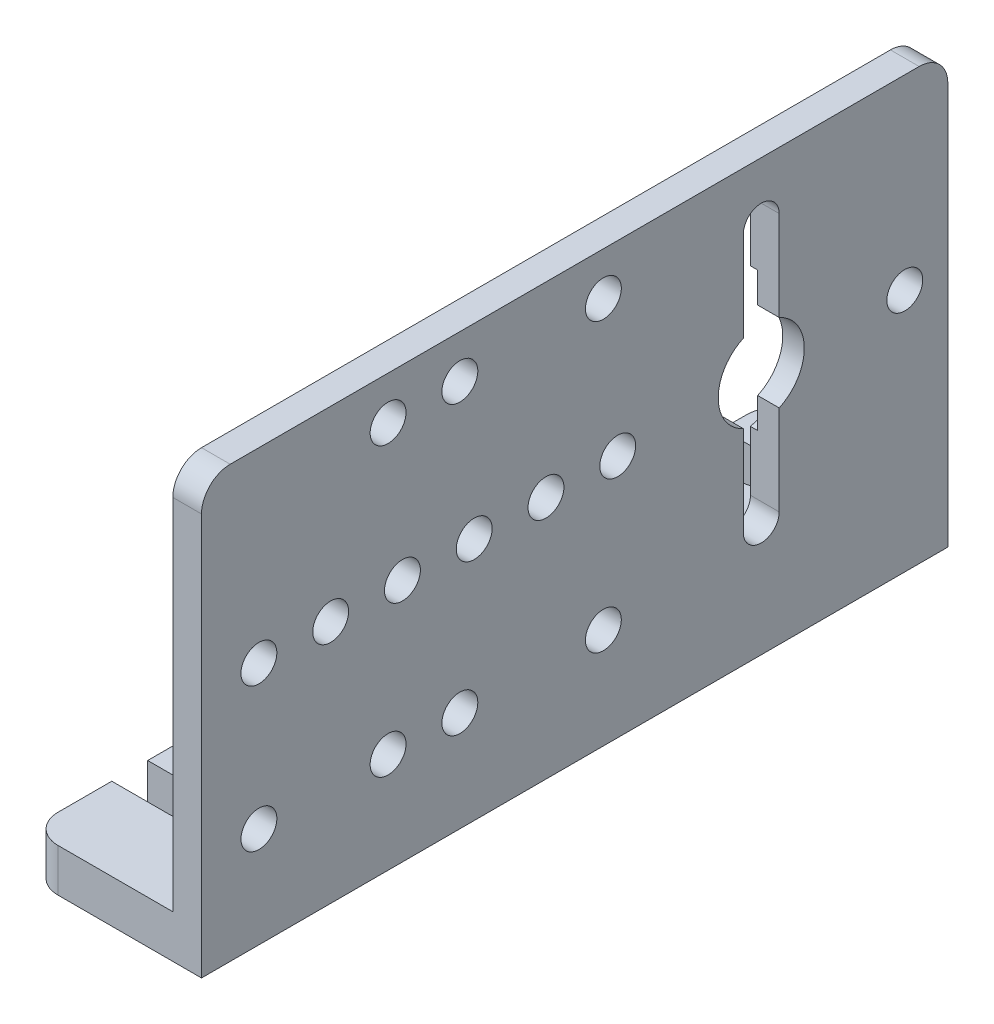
ISO-10303-21;
HEADER;
FILE_DESCRIPTION(('STEP AP214'),'2;1');
FILE_NAME('part.step','',(''),(''),'','','');
FILE_SCHEMA(('AUTOMOTIVE_DESIGN { 1 0 10303 214 1 1 1 1 }'));
ENDSEC;
DATA;
#1=APPLICATION_CONTEXT('core data for automotive mechanical design processes');
#2=APPLICATION_PROTOCOL_DEFINITION('international standard','automotive_design',2000,#1);
#3=PRODUCT_CONTEXT('',#1,'mechanical');
#4=PRODUCT('Part','Part','',(#3));
#5=PRODUCT_RELATED_PRODUCT_CATEGORY('part','',(#4));
#6=PRODUCT_DEFINITION_FORMATION('','',#4);
#7=PRODUCT_DEFINITION_CONTEXT('part definition',#1,'design');
#8=PRODUCT_DEFINITION('design','',#6,#7);
#9=PRODUCT_DEFINITION_SHAPE('','',#8);
#10=(LENGTH_UNIT() NAMED_UNIT(*) SI_UNIT(.MILLI.,.METRE.));
#11=(NAMED_UNIT(*) PLANE_ANGLE_UNIT() SI_UNIT($,.RADIAN.));
#12=(NAMED_UNIT(*) SI_UNIT($,.STERADIAN.) SOLID_ANGLE_UNIT());
#13=UNCERTAINTY_MEASURE_WITH_UNIT(LENGTH_MEASURE(1.E-05),#10,'distance_accuracy_value','');
#14=(GEOMETRIC_REPRESENTATION_CONTEXT(3) GLOBAL_UNCERTAINTY_ASSIGNED_CONTEXT((#13)) GLOBAL_UNIT_ASSIGNED_CONTEXT((#10,
#11,#12)) REPRESENTATION_CONTEXT('',''));
#15=CARTESIAN_POINT('',(0.,0.,0.));
#16=DIRECTION('',(0.,0.,1.));
#17=DIRECTION('',(1.,0.,0.));
#18=AXIS2_PLACEMENT_3D('',#15,#16,#17);
#19=CARTESIAN_POINT('',(-12.,0.,52.));
#20=DIRECTION('',(1.,0.,0.));
#21=DIRECTION('',(0.,1.,0.));
#22=AXIS2_PLACEMENT_3D('',#19,#20,#21);
#23=PLANE('',#22);
#24=DIRECTION('',(0.,0.,-1.));
#25=VECTOR('',#24,1.);
#26=CARTESIAN_POINT('',(-12.,0.,52.));
#27=LINE('',#26,#25);
#28=CARTESIAN_POINT('',(-12.,0.,3.75));
#29=VERTEX_POINT('',#28);
#30=CARTESIAN_POINT('',(-12.,0.,2.00000000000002));
#31=VERTEX_POINT('',#30);
#32=EDGE_CURVE('E716',#29,#31,#27,.T.);
#33=ORIENTED_EDGE('',*,*,#32,.F.);
#34=DIRECTION('',(0.,1.,0.));
#35=VECTOR('',#34,1.);
#36=CARTESIAN_POINT('',(-12.,0.,3.75));
#37=LINE('',#36,#35);
#38=CARTESIAN_POINT('',(-12.,3.,3.75));
#39=VERTEX_POINT('',#38);
#40=EDGE_CURVE('E1159',#29,#39,#37,.T.);
#41=ORIENTED_EDGE('',*,*,#40,.T.);
#42=DIRECTION('',(0.,0.,-1.));
#43=VECTOR('',#42,1.);
#44=CARTESIAN_POINT('',(-12.,3.,52.));
#45=LINE('',#44,#43);
#46=CARTESIAN_POINT('',(-12.,3.,2.00000000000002));
#47=VERTEX_POINT('',#46);
#48=EDGE_CURVE('E599',#39,#47,#45,.T.);
#49=ORIENTED_EDGE('',*,*,#48,.T.);
#50=DIRECTION('',(0.,-1.,0.));
#51=VECTOR('',#50,1.);
#52=CARTESIAN_POINT('',(-12.,0.,2.));
#53=LINE('',#52,#51);
#54=EDGE_CURVE('E629',#47,#31,#53,.T.);
#55=ORIENTED_EDGE('',*,*,#54,.T.);
#56=EDGE_LOOP('',(#33,#41,#49,#55));
#57=FACE_BOUND('',#56,.T.);
#58=ADVANCED_FACE('F350',(#57),#23,.F.);
#59=CARTESIAN_POINT('',(-12.,0.,43.75));
#60=VERTEX_POINT('',#59);
#61=CARTESIAN_POINT('',(-12.,0.,31.25));
#62=VERTEX_POINT('',#61);
#63=EDGE_CURVE('E718',#60,#62,#27,.T.);
#64=ORIENTED_EDGE('',*,*,#63,.F.);
#65=DIRECTION('',(0.,1.,0.));
#66=VECTOR('',#65,1.);
#67=CARTESIAN_POINT('',(-12.,0.,43.75));
#68=LINE('',#67,#66);
#69=CARTESIAN_POINT('',(-12.,3.,43.75));
#70=VERTEX_POINT('',#69);
#71=EDGE_CURVE('E1206',#60,#70,#68,.T.);
#72=ORIENTED_EDGE('',*,*,#71,.T.);
#73=CARTESIAN_POINT('',(-12.,3.,31.25));
#74=VERTEX_POINT('',#73);
#75=EDGE_CURVE('E598',#70,#74,#45,.T.);
#76=ORIENTED_EDGE('',*,*,#75,.T.);
#77=DIRECTION('',(0.,1.,0.));
#78=VECTOR('',#77,1.);
#79=CARTESIAN_POINT('',(-12.,0.,31.25));
#80=LINE('',#79,#78);
#81=EDGE_CURVE('E731',#62,#74,#80,.T.);
#82=ORIENTED_EDGE('',*,*,#81,.F.);
#83=EDGE_LOOP('',(#64,#72,#76,#82));
#84=FACE_BOUND('',#83,.T.);
#85=ADVANCED_FACE('F943',(#84),#23,.F.);
#86=CARTESIAN_POINT('',(-12.,3.,28.75));
#87=VERTEX_POINT('',#86);
#88=CARTESIAN_POINT('',(-12.,3.,6.25));
#89=VERTEX_POINT('',#88);
#90=EDGE_CURVE('E590',#87,#89,#45,.T.);
#91=ORIENTED_EDGE('',*,*,#90,.T.);
#92=DIRECTION('',(0.,1.,0.));
#93=VECTOR('',#92,1.);
#94=CARTESIAN_POINT('',(-12.,0.,6.25));
#95=LINE('',#94,#93);
#96=CARTESIAN_POINT('',(-12.,0.,6.25));
#97=VERTEX_POINT('',#96);
#98=EDGE_CURVE('E571',#97,#89,#95,.T.);
#99=ORIENTED_EDGE('',*,*,#98,.F.);
#100=CARTESIAN_POINT('',(-12.,0.,28.75));
#101=VERTEX_POINT('',#100);
#102=EDGE_CURVE('E719',#101,#97,#27,.T.);
#103=ORIENTED_EDGE('',*,*,#102,.F.);
#104=DIRECTION('',(0.,1.,0.));
#105=VECTOR('',#104,1.);
#106=CARTESIAN_POINT('',(-12.,0.,28.75));
#107=LINE('',#106,#105);
#108=EDGE_CURVE('E597',#101,#87,#107,.T.);
#109=ORIENTED_EDGE('',*,*,#108,.T.);
#110=EDGE_LOOP('',(#91,#99,#103,#109));
#111=FACE_BOUND('',#110,.T.);
#112=ADVANCED_FACE('F596',(#111),#23,.F.);
#113=CARTESIAN_POINT('',(0.,17.,13.));
#114=DIRECTION('',(-1.,0.,0.));
#115=DIRECTION('',(0.,0.,1.));
#116=AXIS2_PLACEMENT_3D('',#113,#114,#115);
#117=CYLINDRICAL_SURFACE('',#116,3.);
#118=CARTESIAN_POINT('',(-1.5,17.,13.));
#119=DIRECTION('',(-1.,0.,0.));
#120=DIRECTION('',(0.,0.,1.));
#121=AXIS2_PLACEMENT_3D('',#118,#119,#120);
#122=CIRCLE('',#121,3.);
#123=CARTESIAN_POINT('',(-1.5,19.7271780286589,14.25));
#124=VERTEX_POINT('',#123);
#125=CARTESIAN_POINT('',(-1.5,14.2728219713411,14.25));
#126=VERTEX_POINT('',#125);
#127=EDGE_CURVE('E659',#124,#126,#122,.F.);
#128=ORIENTED_EDGE('',*,*,#127,.F.);
#129=DIRECTION('',(-1.,0.,0.));
#130=VECTOR('',#129,1.);
#131=CARTESIAN_POINT('',(0.,19.7271780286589,14.25));
#132=LINE('',#131,#130);
#133=CARTESIAN_POINT('',(0.,19.7271780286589,14.25));
#134=VERTEX_POINT('',#133);
#135=EDGE_CURVE('E670',#134,#124,#132,.T.);
#136=ORIENTED_EDGE('',*,*,#135,.F.);
#137=CARTESIAN_POINT('',(0.,17.,13.));
#138=DIRECTION('',(-1.,0.,0.));
#139=DIRECTION('',(0.,0.,1.));
#140=AXIS2_PLACEMENT_3D('',#137,#138,#139);
#141=CIRCLE('',#140,3.);
#142=CARTESIAN_POINT('',(0.,14.2728219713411,14.25));
#143=VERTEX_POINT('',#142);
#144=EDGE_CURVE('E864',#143,#134,#141,.T.);
#145=ORIENTED_EDGE('',*,*,#144,.F.);
#146=DIRECTION('',(-1.,0.,0.));
#147=VECTOR('',#146,1.);
#148=CARTESIAN_POINT('',(0.,14.2728219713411,14.25));
#149=LINE('',#148,#147);
#150=EDGE_CURVE('E672',#143,#126,#149,.T.);
#151=ORIENTED_EDGE('',*,*,#150,.T.);
#152=EDGE_LOOP('',(#128,#136,#145,#151));
#153=FACE_BOUND('',#152,.T.);
#154=ADVANCED_FACE('F668',(#153),#117,.F.);
#155=CARTESIAN_POINT('',(0.,17.,13.));
#156=DIRECTION('',(-1.,0.,0.));
#157=DIRECTION('',(0.,0.,1.));
#158=AXIS2_PLACEMENT_3D('',#155,#156,#157);
#159=CYLINDRICAL_SURFACE('',#158,3.);
#160=CARTESIAN_POINT('',(-1.5,17.,13.));
#161=DIRECTION('',(-1.,0.,0.));
#162=DIRECTION('',(0.,0.,1.));
#163=AXIS2_PLACEMENT_3D('',#160,#161,#162);
#164=CIRCLE('',#163,3.);
#165=CARTESIAN_POINT('',(-1.5,14.2728219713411,11.75));
#166=VERTEX_POINT('',#165);
#167=CARTESIAN_POINT('',(-1.5,19.7271780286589,11.75));
#168=VERTEX_POINT('',#167);
#169=EDGE_CURVE('E751',#166,#168,#164,.F.);
#170=ORIENTED_EDGE('',*,*,#169,.F.);
#171=DIRECTION('',(-1.,0.,0.));
#172=VECTOR('',#171,1.);
#173=CARTESIAN_POINT('',(0.,14.2728219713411,11.75));
#174=LINE('',#173,#172);
#175=CARTESIAN_POINT('',(0.,14.2728219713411,11.75));
#176=VERTEX_POINT('',#175);
#177=EDGE_CURVE('E887',#176,#166,#174,.T.);
#178=ORIENTED_EDGE('',*,*,#177,.F.);
#179=CARTESIAN_POINT('',(0.,17.,13.));
#180=DIRECTION('',(-1.,0.,0.));
#181=DIRECTION('',(0.,0.,1.));
#182=AXIS2_PLACEMENT_3D('',#179,#180,#181);
#183=CIRCLE('',#182,3.);
#184=CARTESIAN_POINT('',(0.,19.7271780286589,11.75));
#185=VERTEX_POINT('',#184);
#186=EDGE_CURVE('E873',#185,#176,#183,.T.);
#187=ORIENTED_EDGE('',*,*,#186,.F.);
#188=DIRECTION('',(-1.,0.,0.));
#189=VECTOR('',#188,1.);
#190=CARTESIAN_POINT('',(0.,19.7271780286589,11.75));
#191=LINE('',#190,#189);
#192=EDGE_CURVE('E890',#185,#168,#191,.T.);
#193=ORIENTED_EDGE('',*,*,#192,.T.);
#194=EDGE_LOOP('',(#170,#178,#187,#193));
#195=FACE_BOUND('',#194,.T.);
#196=ADVANCED_FACE('F919',(#195),#159,.F.);
#197=CARTESIAN_POINT('',(-2.,30.,52.));
#198=DIRECTION('',(0.,-1.,0.));
#199=DIRECTION('',(0.,0.,-1.));
#200=AXIS2_PLACEMENT_3D('',#197,#198,#199);
#201=PLANE('',#200);
#202=DIRECTION('',(0.,0.,-1.));
#203=VECTOR('',#202,1.);
#204=CARTESIAN_POINT('',(-2.,30.,52.));
#205=LINE('',#204,#203);
#206=CARTESIAN_POINT('',(-2.,30.,50.));
#207=VERTEX_POINT('',#206);
#208=CARTESIAN_POINT('',(-2.,30.,2.00000000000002));
#209=VERTEX_POINT('',#208);
#210=EDGE_CURVE('E611',#207,#209,#205,.T.);
#211=ORIENTED_EDGE('',*,*,#210,.F.);
#212=DIRECTION('',(-1.,0.,0.));
#213=VECTOR('',#212,1.);
#214=CARTESIAN_POINT('',(0.,30.,50.));
#215=LINE('',#214,#213);
#216=CARTESIAN_POINT('',(0.,30.,50.));
#217=VERTEX_POINT('',#216);
#218=EDGE_CURVE('E650',#207,#217,#215,.F.);
#219=ORIENTED_EDGE('',*,*,#218,.T.);
#220=DIRECTION('',(0.,0.,-1.));
#221=VECTOR('',#220,1.);
#222=CARTESIAN_POINT('',(0.,30.,52.));
#223=LINE('',#222,#221);
#224=CARTESIAN_POINT('',(0.,30.,2.00000000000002));
#225=VERTEX_POINT('',#224);
#226=EDGE_CURVE('E711',#217,#225,#223,.T.);
#227=ORIENTED_EDGE('',*,*,#226,.T.);
#228=DIRECTION('',(-1.,0.,0.));
#229=VECTOR('',#228,1.);
#230=CARTESIAN_POINT('',(-2.,30.,2.));
#231=LINE('',#230,#229);
#232=EDGE_CURVE('E647',#225,#209,#231,.T.);
#233=ORIENTED_EDGE('',*,*,#232,.T.);
#234=EDGE_LOOP('',(#211,#219,#227,#233));
#235=FACE_BOUND('',#234,.T.);
#236=ADVANCED_FACE('F352',(#235),#201,.F.);
#237=CARTESIAN_POINT('',(-2.,3.,52.));
#238=DIRECTION('',(1.,0.,0.));
#239=DIRECTION('',(0.,0.,-1.));
#240=AXIS2_PLACEMENT_3D('',#237,#238,#239);
#241=PLANE('',#240);
#242=CARTESIAN_POINT('',(-2.,7.,34.));
#243=DIRECTION('',(-1.,0.,0.));
#244=DIRECTION('',(0.,0.,-1.));
#245=AXIS2_PLACEMENT_3D('',#242,#243,#244);
#246=CIRCLE('',#245,1.25);
#247=CARTESIAN_POINT('',(-2.,7.,32.75));
#248=VERTEX_POINT('',#247);
#249=EDGE_CURVE('E764',#248,#248,#246,.T.);
#250=ORIENTED_EDGE('',*,*,#249,.F.);
#251=EDGE_LOOP('',(#250));
#252=FACE_BOUND('',#251,.T.);
#253=CARTESIAN_POINT('',(-2.,7.00000000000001,24.));
#254=DIRECTION('',(-1.,0.,0.));
#255=DIRECTION('',(0.,0.,-1.));
#256=AXIS2_PLACEMENT_3D('',#253,#254,#255);
#257=CIRCLE('',#256,1.25);
#258=CARTESIAN_POINT('',(-2.,7.00000000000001,22.75));
#259=VERTEX_POINT('',#258);
#260=EDGE_CURVE('E770',#259,#259,#257,.T.);
#261=ORIENTED_EDGE('',*,*,#260,.F.);
#262=EDGE_LOOP('',(#261));
#263=FACE_BOUND('',#262,.T.);
#264=CARTESIAN_POINT('',(-2.,7.,39.));
#265=DIRECTION('',(-1.,0.,0.));
#266=DIRECTION('',(0.,0.,-1.));
#267=AXIS2_PLACEMENT_3D('',#264,#265,#266);
#268=CIRCLE('',#267,1.25);
#269=CARTESIAN_POINT('',(-2.,7.,37.75));
#270=VERTEX_POINT('',#269);
#271=EDGE_CURVE('E776',#270,#270,#268,.T.);
#272=ORIENTED_EDGE('',*,*,#271,.F.);
#273=EDGE_LOOP('',(#272));
#274=FACE_BOUND('',#273,.T.);
#275=CARTESIAN_POINT('',(-2.,7.,48.));
#276=DIRECTION('',(-1.,0.,0.));
#277=DIRECTION('',(0.,0.,1.));
#278=AXIS2_PLACEMENT_3D('',#275,#276,#277);
#279=CIRCLE('',#278,1.25000000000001);
#280=CARTESIAN_POINT('',(-2.,7.,49.25));
#281=VERTEX_POINT('',#280);
#282=EDGE_CURVE('E782',#281,#281,#279,.T.);
#283=ORIENTED_EDGE('',*,*,#282,.F.);
#284=EDGE_LOOP('',(#283));
#285=FACE_BOUND('',#284,.T.);
#286=CARTESIAN_POINT('',(-2.,27.,39.));
#287=DIRECTION('',(-1.,0.,0.));
#288=DIRECTION('',(0.,0.,1.));
#289=AXIS2_PLACEMENT_3D('',#286,#287,#288);
#290=CIRCLE('',#289,1.25);
#291=CARTESIAN_POINT('',(-2.,27.,40.25));
#292=VERTEX_POINT('',#291);
#293=EDGE_CURVE('E788',#292,#292,#290,.T.);
#294=ORIENTED_EDGE('',*,*,#293,.F.);
#295=EDGE_LOOP('',(#294));
#296=FACE_BOUND('',#295,.T.);
#297=CARTESIAN_POINT('',(-2.,27.,34.));
#298=DIRECTION('',(-1.,0.,0.));
#299=DIRECTION('',(0.,0.,1.));
#300=AXIS2_PLACEMENT_3D('',#297,#298,#299);
#301=CIRCLE('',#300,1.25);
#302=CARTESIAN_POINT('',(-2.,27.,35.25));
#303=VERTEX_POINT('',#302);
#304=EDGE_CURVE('E794',#303,#303,#301,.T.);
#305=ORIENTED_EDGE('',*,*,#304,.F.);
#306=EDGE_LOOP('',(#305));
#307=FACE_BOUND('',#306,.T.);
#308=CARTESIAN_POINT('',(-2.,27.,24.));
#309=DIRECTION('',(-1.,0.,0.));
#310=DIRECTION('',(0.,0.,1.));
#311=AXIS2_PLACEMENT_3D('',#308,#309,#310);
#312=CIRCLE('',#311,1.25);
#313=CARTESIAN_POINT('',(-2.,27.,25.25));
#314=VERTEX_POINT('',#313);
#315=EDGE_CURVE('E800',#314,#314,#312,.T.);
#316=ORIENTED_EDGE('',*,*,#315,.F.);
#317=EDGE_LOOP('',(#316));
#318=FACE_BOUND('',#317,.T.);
#319=CARTESIAN_POINT('',(-2.,17.,48.));
#320=DIRECTION('',(-1.,0.,0.));
#321=DIRECTION('',(0.,0.,-1.));
#322=AXIS2_PLACEMENT_3D('',#319,#320,#321);
#323=CIRCLE('',#322,1.25);
#324=CARTESIAN_POINT('',(-2.,17.,46.75));
#325=VERTEX_POINT('',#324);
#326=EDGE_CURVE('E806',#325,#325,#323,.T.);
#327=ORIENTED_EDGE('',*,*,#326,.F.);
#328=EDGE_LOOP('',(#327));
#329=FACE_BOUND('',#328,.T.);
#330=CARTESIAN_POINT('',(-2.,17.,43.));
#331=DIRECTION('',(-1.,0.,0.));
#332=DIRECTION('',(0.,0.,-1.));
#333=AXIS2_PLACEMENT_3D('',#330,#331,#332);
#334=CIRCLE('',#333,1.25);
#335=CARTESIAN_POINT('',(-2.,17.,41.75));
#336=VERTEX_POINT('',#335);
#337=EDGE_CURVE('E812',#336,#336,#334,.T.);
#338=ORIENTED_EDGE('',*,*,#337,.F.);
#339=EDGE_LOOP('',(#338));
#340=FACE_BOUND('',#339,.T.);
#341=CARTESIAN_POINT('',(-2.,17.,38.));
#342=DIRECTION('',(-1.,0.,0.));
#343=DIRECTION('',(0.,0.,-1.));
#344=AXIS2_PLACEMENT_3D('',#341,#342,#343);
#345=CIRCLE('',#344,1.25);
#346=CARTESIAN_POINT('',(-2.,17.,36.75));
#347=VERTEX_POINT('',#346);
#348=EDGE_CURVE('E818',#347,#347,#345,.T.);
#349=ORIENTED_EDGE('',*,*,#348,.F.);
#350=EDGE_LOOP('',(#349));
#351=FACE_BOUND('',#350,.T.);
#352=CARTESIAN_POINT('',(-2.,17.,33.));
#353=DIRECTION('',(-1.,0.,0.));
#354=DIRECTION('',(0.,0.,-1.));
#355=AXIS2_PLACEMENT_3D('',#352,#353,#354);
#356=CIRCLE('',#355,1.25);
#357=CARTESIAN_POINT('',(-2.,17.,31.75));
#358=VERTEX_POINT('',#357);
#359=EDGE_CURVE('E824',#358,#358,#356,.T.);
#360=ORIENTED_EDGE('',*,*,#359,.F.);
#361=EDGE_LOOP('',(#360));
#362=FACE_BOUND('',#361,.T.);
#363=CARTESIAN_POINT('',(-2.,17.,28.));
#364=DIRECTION('',(-1.,0.,0.));
#365=DIRECTION('',(0.,0.,-1.));
#366=AXIS2_PLACEMENT_3D('',#363,#364,#365);
#367=CIRCLE('',#366,1.25);
#368=CARTESIAN_POINT('',(-2.,17.,26.75));
#369=VERTEX_POINT('',#368);
#370=EDGE_CURVE('E830',#369,#369,#367,.T.);
#371=ORIENTED_EDGE('',*,*,#370,.F.);
#372=EDGE_LOOP('',(#371));
#373=FACE_BOUND('',#372,.T.);
#374=CARTESIAN_POINT('',(-2.,17.,23.));
#375=DIRECTION('',(-1.,0.,0.));
#376=DIRECTION('',(0.,0.,-1.));
#377=AXIS2_PLACEMENT_3D('',#374,#375,#376);
#378=CIRCLE('',#377,1.25);
#379=CARTESIAN_POINT('',(-2.,17.,21.75));
#380=VERTEX_POINT('',#379);
#381=EDGE_CURVE('E836',#380,#380,#378,.T.);
#382=ORIENTED_EDGE('',*,*,#381,.F.);
#383=EDGE_LOOP('',(#382));
#384=FACE_BOUND('',#383,.T.);
#385=CARTESIAN_POINT('',(-2.,17.,3.));
#386=DIRECTION('',(-1.,0.,0.));
#387=DIRECTION('',(0.,0.,1.));
#388=AXIS2_PLACEMENT_3D('',#385,#386,#387);
#389=CIRCLE('',#388,1.25);
#390=CARTESIAN_POINT('',(-2.,17.,4.25));
#391=VERTEX_POINT('',#390);
#392=EDGE_CURVE('E842',#391,#391,#389,.T.);
#393=ORIENTED_EDGE('',*,*,#392,.F.);
#394=EDGE_LOOP('',(#393));
#395=FACE_BOUND('',#394,.T.);
#396=DIRECTION('',(0.,1.,0.));
#397=VECTOR('',#396,1.);
#398=CARTESIAN_POINT('',(-2.,26.,14.25));
#399=LINE('',#398,#397);
#400=CARTESIAN_POINT('',(-2.,21.8412291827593,14.25));
#401=VERTEX_POINT('',#400);
#402=CARTESIAN_POINT('',(-2.,26.,14.25));
#403=VERTEX_POINT('',#402);
#404=EDGE_CURVE('E848',#401,#403,#399,.T.);
#405=ORIENTED_EDGE('',*,*,#404,.F.);
#406=CARTESIAN_POINT('',(-2.,17.,13.));
#407=DIRECTION('',(-1.,0.,0.));
#408=DIRECTION('',(0.,0.,1.));
#409=AXIS2_PLACEMENT_3D('',#406,#407,#408);
#410=CIRCLE('',#409,5.);
#411=CARTESIAN_POINT('',(-2.,12.1587708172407,14.25));
#412=VERTEX_POINT('',#411);
#413=EDGE_CURVE('E741',#412,#401,#410,.T.);
#414=ORIENTED_EDGE('',*,*,#413,.F.);
#415=DIRECTION('',(0.,1.,0.));
#416=VECTOR('',#415,1.);
#417=CARTESIAN_POINT('',(-2.,14.2728219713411,14.25));
#418=LINE('',#417,#416);
#419=CARTESIAN_POINT('',(-2.,8.,14.25));
#420=VERTEX_POINT('',#419);
#421=EDGE_CURVE('E861',#420,#412,#418,.T.);
#422=ORIENTED_EDGE('',*,*,#421,.F.);
#423=CARTESIAN_POINT('',(-2.,8.,13.));
#424=DIRECTION('',(-1.,0.,0.));
#425=DIRECTION('',(0.,0.,1.));
#426=AXIS2_PLACEMENT_3D('',#423,#424,#425);
#427=CIRCLE('',#426,1.25);
#428=CARTESIAN_POINT('',(-2.,8.,11.75));
#429=VERTEX_POINT('',#428);
#430=EDGE_CURVE('E858',#429,#420,#427,.T.);
#431=ORIENTED_EDGE('',*,*,#430,.F.);
#432=DIRECTION('',(0.,-1.,0.));
#433=VECTOR('',#432,1.);
#434=CARTESIAN_POINT('',(-2.,14.2728219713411,11.75));
#435=LINE('',#434,#433);
#436=CARTESIAN_POINT('',(-2.,12.1587708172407,11.75));
#437=VERTEX_POINT('',#436);
#438=EDGE_CURVE('E856',#437,#429,#435,.T.);
#439=ORIENTED_EDGE('',*,*,#438,.F.);
#440=CARTESIAN_POINT('',(-2.,21.8412291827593,11.75));
#441=VERTEX_POINT('',#440);
#442=EDGE_CURVE('E746',#441,#437,#410,.T.);
#443=ORIENTED_EDGE('',*,*,#442,.F.);
#444=DIRECTION('',(0.,-1.,0.));
#445=VECTOR('',#444,1.);
#446=CARTESIAN_POINT('',(-2.,26.,11.75));
#447=LINE('',#446,#445);
#448=CARTESIAN_POINT('',(-2.,26.,11.75));
#449=VERTEX_POINT('',#448);
#450=EDGE_CURVE('E853',#449,#441,#447,.T.);
#451=ORIENTED_EDGE('',*,*,#450,.F.);
#452=CARTESIAN_POINT('',(-2.,26.,13.));
#453=DIRECTION('',(-1.,0.,0.));
#454=DIRECTION('',(0.,0.,1.));
#455=AXIS2_PLACEMENT_3D('',#452,#453,#454);
#456=CIRCLE('',#455,1.25);
#457=EDGE_CURVE('E850',#403,#449,#456,.T.);
#458=ORIENTED_EDGE('',*,*,#457,.F.);
#459=EDGE_LOOP('',(#405,#414,#422,#431,#439,#443,#451,#458));
#460=FACE_BOUND('',#459,.T.);
#461=DIRECTION('',(0.,-1.,0.));
#462=VECTOR('',#461,1.);
#463=CARTESIAN_POINT('',(-2.,3.,52.));
#464=LINE('',#463,#462);
#465=CARTESIAN_POINT('',(-2.,28.,52.));
#466=VERTEX_POINT('',#465);
#467=CARTESIAN_POINT('',(-2.,3.,52.));
#468=VERTEX_POINT('',#467);
#469=EDGE_CURVE('E701',#466,#468,#464,.T.);
#470=ORIENTED_EDGE('',*,*,#469,.F.);
#471=CARTESIAN_POINT('',(-2.,28.,50.));
#472=DIRECTION('',(1.,0.,0.));
#473=DIRECTION('',(0.,0.,-1.));
#474=AXIS2_PLACEMENT_3D('',#471,#472,#473);
#475=CIRCLE('',#474,2.);
#476=EDGE_CURVE('E645',#466,#207,#475,.F.);
#477=ORIENTED_EDGE('',*,*,#476,.T.);
#478=ORIENTED_EDGE('',*,*,#210,.T.);
#479=CARTESIAN_POINT('',(-2.,28.,2.));
#480=DIRECTION('',(1.,0.,0.));
#481=DIRECTION('',(0.,0.,-1.));
#482=AXIS2_PLACEMENT_3D('',#479,#480,#481);
#483=CIRCLE('',#482,2.);
#484=CARTESIAN_POINT('',(-2.,28.,0.));
#485=VERTEX_POINT('',#484);
#486=EDGE_CURVE('E643',#209,#485,#483,.F.);
#487=ORIENTED_EDGE('',*,*,#486,.T.);
#488=DIRECTION('',(0.,-1.,0.));
#489=VECTOR('',#488,1.);
#490=CARTESIAN_POINT('',(-2.,3.,0.));
#491=LINE('',#490,#489);
#492=CARTESIAN_POINT('',(-2.,3.,0.));
#493=VERTEX_POINT('',#492);
#494=EDGE_CURVE('E692',#485,#493,#491,.T.);
#495=ORIENTED_EDGE('',*,*,#494,.T.);
#496=DIRECTION('',(0.,0.,-1.));
#497=VECTOR('',#496,1.);
#498=CARTESIAN_POINT('',(-2.,3.,52.));
#499=LINE('',#498,#497);
#500=EDGE_CURVE('E606',#468,#493,#499,.T.);
#501=ORIENTED_EDGE('',*,*,#500,.F.);
#502=EDGE_LOOP('',(#470,#477,#478,#487,#495,#501));
#503=FACE_BOUND('',#502,.T.);
#504=ADVANCED_FACE('F902',(#252,#263,#274,#285,#296,#307,#318,#329,#340,#351,#362,#373,#384,
#395,#460,#503),#241,.F.);
#505=CARTESIAN_POINT('',(-12.,3.,52.));
#506=DIRECTION('',(0.,-1.,0.));
#507=DIRECTION('',(0.,0.,-1.));
#508=AXIS2_PLACEMENT_3D('',#505,#506,#507);
#509=PLANE('',#508);
#510=ORIENTED_EDGE('',*,*,#48,.F.);
#511=DIRECTION('',(-1.,0.,0.));
#512=VECTOR('',#511,1.);
#513=CARTESIAN_POINT('',(-8.00000000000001,3.,3.75));
#514=LINE('',#513,#512);
#515=CARTESIAN_POINT('',(-8.00000000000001,3.,3.75));
#516=VERTEX_POINT('',#515);
#517=EDGE_CURVE('E1156',#516,#39,#514,.T.);
#518=ORIENTED_EDGE('',*,*,#517,.F.);
#519=CARTESIAN_POINT('',(-8.00000000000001,3.,5.));
#520=DIRECTION('',(0.,1.,0.));
#521=DIRECTION('',(0.,0.,1.));
#522=AXIS2_PLACEMENT_3D('',#519,#520,#521);
#523=CIRCLE('',#522,1.25);
#524=CARTESIAN_POINT('',(-8.00000000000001,3.,6.25));
#525=VERTEX_POINT('',#524);
#526=EDGE_CURVE('E593',#525,#516,#523,.T.);
#527=ORIENTED_EDGE('',*,*,#526,.F.);
#528=DIRECTION('',(1.,0.,0.));
#529=VECTOR('',#528,1.);
#530=CARTESIAN_POINT('',(-8.00000000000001,3.,6.25));
#531=LINE('',#530,#529);
#532=EDGE_CURVE('E574',#89,#525,#531,.T.);
#533=ORIENTED_EDGE('',*,*,#532,.F.);
#534=ORIENTED_EDGE('',*,*,#90,.F.);
#535=DIRECTION('',(-1.,0.,0.));
#536=VECTOR('',#535,1.);
#537=CARTESIAN_POINT('',(-8.,3.,28.75));
#538=LINE('',#537,#536);
#539=CARTESIAN_POINT('',(-8.,3.,28.75));
#540=VERTEX_POINT('',#539);
#541=EDGE_CURVE('E1220',#540,#87,#538,.T.);
#542=ORIENTED_EDGE('',*,*,#541,.F.);
#543=CARTESIAN_POINT('',(-8.,3.,30.));
#544=DIRECTION('',(0.,1.,0.));
#545=DIRECTION('',(0.,0.,1.));
#546=AXIS2_PLACEMENT_3D('',#543,#544,#545);
#547=CIRCLE('',#546,1.25);
#548=CARTESIAN_POINT('',(-8.,3.,31.25));
#549=VERTEX_POINT('',#548);
#550=EDGE_CURVE('E1217',#549,#540,#547,.T.);
#551=ORIENTED_EDGE('',*,*,#550,.F.);
#552=DIRECTION('',(1.,0.,0.));
#553=VECTOR('',#552,1.);
#554=CARTESIAN_POINT('',(-8.,3.,31.25));
#555=LINE('',#554,#553);
#556=EDGE_CURVE('E1209',#74,#549,#555,.T.);
#557=ORIENTED_EDGE('',*,*,#556,.F.);
#558=ORIENTED_EDGE('',*,*,#75,.F.);
#559=DIRECTION('',(-1.,0.,0.));
#560=VECTOR('',#559,1.);
#561=CARTESIAN_POINT('',(-8.,3.,43.75));
#562=LINE('',#561,#560);
#563=CARTESIAN_POINT('',(-8.,3.,43.75));
#564=VERTEX_POINT('',#563);
#565=EDGE_CURVE('E1195',#564,#70,#562,.T.);
#566=ORIENTED_EDGE('',*,*,#565,.F.);
#567=CARTESIAN_POINT('',(-8.,3.,45.));
#568=DIRECTION('',(0.,1.,0.));
#569=DIRECTION('',(0.,0.,1.));
#570=AXIS2_PLACEMENT_3D('',#567,#568,#569);
#571=CIRCLE('',#570,1.25);
#572=CARTESIAN_POINT('',(-8.,3.,46.25));
#573=VERTEX_POINT('',#572);
#574=EDGE_CURVE('E1193',#573,#564,#571,.T.);
#575=ORIENTED_EDGE('',*,*,#574,.F.);
#576=DIRECTION('',(1.,0.,0.));
#577=VECTOR('',#576,1.);
#578=CARTESIAN_POINT('',(-8.,3.,46.25));
#579=LINE('',#578,#577);
#580=CARTESIAN_POINT('',(-12.,3.,46.25));
#581=VERTEX_POINT('',#580);
#582=EDGE_CURVE('E1163',#581,#573,#579,.T.);
#583=ORIENTED_EDGE('',*,*,#582,.F.);
#584=CARTESIAN_POINT('',(-12.,3.,50.));
#585=VERTEX_POINT('',#584);
#586=EDGE_CURVE('E601',#585,#581,#45,.T.);
#587=ORIENTED_EDGE('',*,*,#586,.F.);
#588=CARTESIAN_POINT('',(-10.,3.,50.));
#589=DIRECTION('',(0.,-1.,0.));
#590=DIRECTION('',(0.,0.,-1.));
#591=AXIS2_PLACEMENT_3D('',#588,#589,#590);
#592=CIRCLE('',#591,2.);
#593=CARTESIAN_POINT('',(-10.,3.,52.));
#594=VERTEX_POINT('',#593);
#595=EDGE_CURVE('E637',#585,#594,#592,.F.);
#596=ORIENTED_EDGE('',*,*,#595,.T.);
#597=DIRECTION('',(-1.,0.,0.));
#598=VECTOR('',#597,1.);
#599=CARTESIAN_POINT('',(-12.,3.,52.));
#600=LINE('',#599,#598);
#601=EDGE_CURVE('E703',#468,#594,#600,.T.);
#602=ORIENTED_EDGE('',*,*,#601,.F.);
#603=ORIENTED_EDGE('',*,*,#500,.T.);
#604=DIRECTION('',(-1.,0.,0.));
#605=VECTOR('',#604,1.);
#606=CARTESIAN_POINT('',(-12.,3.,0.));
#607=LINE('',#606,#605);
#608=CARTESIAN_POINT('',(-10.,3.,0.));
#609=VERTEX_POINT('',#608);
#610=EDGE_CURVE('E694',#493,#609,#607,.T.);
#611=ORIENTED_EDGE('',*,*,#610,.T.);
#612=CARTESIAN_POINT('',(-10.,3.,2.));
#613=DIRECTION('',(0.,-1.,0.));
#614=DIRECTION('',(0.,0.,-1.));
#615=AXIS2_PLACEMENT_3D('',#612,#613,#614);
#616=CIRCLE('',#615,2.);
#617=EDGE_CURVE('E634',#609,#47,#616,.F.);
#618=ORIENTED_EDGE('',*,*,#617,.T.);
#619=EDGE_LOOP('',(#510,#518,#527,#533,#534,#542,#551,#557,#558,#566,#575,#583,#587,#596,#602,
#603,#611,#618));
#620=FACE_BOUND('',#619,.T.);
#621=ADVANCED_FACE('F588',(#620),#509,.F.);
#622=ORIENTED_EDGE('',*,*,#586,.T.);
#623=DIRECTION('',(0.,1.,0.));
#624=VECTOR('',#623,1.);
#625=CARTESIAN_POINT('',(-12.,0.,46.25));
#626=LINE('',#625,#624);
#627=CARTESIAN_POINT('',(-12.,0.,46.25));
#628=VERTEX_POINT('',#627);
#629=EDGE_CURVE('E1186',#628,#581,#626,.T.);
#630=ORIENTED_EDGE('',*,*,#629,.F.);
#631=CARTESIAN_POINT('',(-12.,0.,50.));
#632=VERTEX_POINT('',#631);
#633=EDGE_CURVE('E602',#632,#628,#27,.T.);
#634=ORIENTED_EDGE('',*,*,#633,.F.);
#635=DIRECTION('',(0.,-1.,0.));
#636=VECTOR('',#635,1.);
#637=CARTESIAN_POINT('',(-12.,3.,50.));
#638=LINE('',#637,#636);
#639=EDGE_CURVE('E632',#632,#585,#638,.F.);
#640=ORIENTED_EDGE('',*,*,#639,.T.);
#641=EDGE_LOOP('',(#622,#630,#634,#640));
#642=FACE_BOUND('',#641,.T.);
#643=ADVANCED_FACE('F946',(#642),#23,.F.);
#644=CARTESIAN_POINT('',(0.,0.,52.));
#645=DIRECTION('',(0.,1.,0.));
#646=DIRECTION('',(-1.,0.,0.));
#647=AXIS2_PLACEMENT_3D('',#644,#645,#646);
#648=PLANE('',#647);
#649=CARTESIAN_POINT('',(-8.00000000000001,0.,5.));
#650=DIRECTION('',(0.,1.,0.));
#651=DIRECTION('',(0.,0.,1.));
#652=AXIS2_PLACEMENT_3D('',#649,#650,#651);
#653=CIRCLE('',#652,1.25);
#654=CARTESIAN_POINT('',(-8.00000000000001,0.,6.25));
#655=VERTEX_POINT('',#654);
#656=CARTESIAN_POINT('',(-8.00000000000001,0.,3.75));
#657=VERTEX_POINT('',#656);
#658=EDGE_CURVE('E365',#655,#657,#653,.T.);
#659=ORIENTED_EDGE('',*,*,#658,.T.);
#660=DIRECTION('',(-1.,0.,0.));
#661=VECTOR('',#660,1.);
#662=CARTESIAN_POINT('',(-8.00000000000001,0.,3.75));
#663=LINE('',#662,#661);
#664=EDGE_CURVE('E583',#657,#29,#663,.T.);
#665=ORIENTED_EDGE('',*,*,#664,.T.);
#666=ORIENTED_EDGE('',*,*,#32,.T.);
#667=CARTESIAN_POINT('',(-10.,0.,2.));
#668=DIRECTION('',(0.,1.,0.));
#669=DIRECTION('',(-1.,0.,0.));
#670=AXIS2_PLACEMENT_3D('',#667,#668,#669);
#671=CIRCLE('',#670,2.);
#672=CARTESIAN_POINT('',(-10.,0.,0.));
#673=VERTEX_POINT('',#672);
#674=EDGE_CURVE('E625',#31,#673,#671,.F.);
#675=ORIENTED_EDGE('',*,*,#674,.T.);
#676=DIRECTION('',(1.,0.,0.));
#677=VECTOR('',#676,1.);
#678=CARTESIAN_POINT('',(0.,0.,0.));
#679=LINE('',#678,#677);
#680=CARTESIAN_POINT('',(0.,0.,0.));
#681=VERTEX_POINT('',#680);
#682=EDGE_CURVE('E696',#673,#681,#679,.T.);
#683=ORIENTED_EDGE('',*,*,#682,.T.);
#684=DIRECTION('',(0.,0.,-1.));
#685=VECTOR('',#684,1.);
#686=CARTESIAN_POINT('',(0.,0.,52.));
#687=LINE('',#686,#685);
#688=CARTESIAN_POINT('',(0.,0.,52.));
#689=VERTEX_POINT('',#688);
#690=EDGE_CURVE('E714',#689,#681,#687,.T.);
#691=ORIENTED_EDGE('',*,*,#690,.F.);
#692=DIRECTION('',(1.,0.,0.));
#693=VECTOR('',#692,1.);
#694=CARTESIAN_POINT('',(0.,0.,52.));
#695=LINE('',#694,#693);
#696=CARTESIAN_POINT('',(-10.,0.,52.));
#697=VERTEX_POINT('',#696);
#698=EDGE_CURVE('E706',#697,#689,#695,.T.);
#699=ORIENTED_EDGE('',*,*,#698,.F.);
#700=CARTESIAN_POINT('',(-10.,0.,50.));
#701=DIRECTION('',(0.,1.,0.));
#702=DIRECTION('',(-1.,0.,0.));
#703=AXIS2_PLACEMENT_3D('',#700,#701,#702);
#704=CIRCLE('',#703,2.);
#705=EDGE_CURVE('E627',#697,#632,#704,.F.);
#706=ORIENTED_EDGE('',*,*,#705,.T.);
#707=ORIENTED_EDGE('',*,*,#633,.T.);
#708=DIRECTION('',(1.,0.,0.));
#709=VECTOR('',#708,1.);
#710=CARTESIAN_POINT('',(-8.,0.,46.25));
#711=LINE('',#710,#709);
#712=CARTESIAN_POINT('',(-8.,0.,46.25));
#713=VERTEX_POINT('',#712);
#714=EDGE_CURVE('E1200',#628,#713,#711,.T.);
#715=ORIENTED_EDGE('',*,*,#714,.T.);
#716=CARTESIAN_POINT('',(-8.,0.,45.));
#717=DIRECTION('',(0.,1.,0.));
#718=DIRECTION('',(0.,0.,1.));
#719=AXIS2_PLACEMENT_3D('',#716,#717,#718);
#720=CIRCLE('',#719,1.25);
#721=CARTESIAN_POINT('',(-8.,0.,43.75));
#722=VERTEX_POINT('',#721);
#723=EDGE_CURVE('E373',#713,#722,#720,.T.);
#724=ORIENTED_EDGE('',*,*,#723,.T.);
#725=DIRECTION('',(-1.,0.,0.));
#726=VECTOR('',#725,1.);
#727=CARTESIAN_POINT('',(-8.,0.,43.75));
#728=LINE('',#727,#726);
#729=EDGE_CURVE('E1203',#722,#60,#728,.T.);
#730=ORIENTED_EDGE('',*,*,#729,.T.);
#731=ORIENTED_EDGE('',*,*,#63,.T.);
#732=DIRECTION('',(1.,0.,0.));
#733=VECTOR('',#732,1.);
#734=CARTESIAN_POINT('',(-8.,0.,31.25));
#735=LINE('',#734,#733);
#736=CARTESIAN_POINT('',(-8.,0.,31.25));
#737=VERTEX_POINT('',#736);
#738=EDGE_CURVE('E736',#62,#737,#735,.T.);
#739=ORIENTED_EDGE('',*,*,#738,.T.);
#740=CARTESIAN_POINT('',(-8.,0.,30.));
#741=DIRECTION('',(0.,1.,0.));
#742=DIRECTION('',(0.,0.,1.));
#743=AXIS2_PLACEMENT_3D('',#740,#741,#742);
#744=CIRCLE('',#743,1.25);
#745=CARTESIAN_POINT('',(-8.,0.,28.75));
#746=VERTEX_POINT('',#745);
#747=EDGE_CURVE('E729',#737,#746,#744,.T.);
#748=ORIENTED_EDGE('',*,*,#747,.T.);
#749=DIRECTION('',(-1.,0.,0.));
#750=VECTOR('',#749,1.);
#751=CARTESIAN_POINT('',(-8.,0.,28.75));
#752=LINE('',#751,#750);
#753=EDGE_CURVE('E727',#746,#101,#752,.T.);
#754=ORIENTED_EDGE('',*,*,#753,.T.);
#755=ORIENTED_EDGE('',*,*,#102,.T.);
#756=DIRECTION('',(1.,0.,0.));
#757=VECTOR('',#756,1.);
#758=CARTESIAN_POINT('',(-8.00000000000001,0.,6.25));
#759=LINE('',#758,#757);
#760=EDGE_CURVE('E577',#97,#655,#759,.T.);
#761=ORIENTED_EDGE('',*,*,#760,.T.);
#762=EDGE_LOOP('',(#659,#665,#666,#675,#683,#691,#699,#706,#707,#715,#724,#730,#731,#739,#748,
#754,#755,#761));
#763=FACE_BOUND('',#762,.T.);
#764=ADVANCED_FACE('F724',(#763),#648,.F.);
#765=CARTESIAN_POINT('',(0.,30.,52.));
#766=DIRECTION('',(-1.,0.,0.));
#767=DIRECTION('',(0.,-1.,0.));
#768=AXIS2_PLACEMENT_3D('',#765,#766,#767);
#769=PLANE('',#768);
#770=CARTESIAN_POINT('',(0.,7.,34.));
#771=DIRECTION('',(-1.,0.,0.));
#772=DIRECTION('',(0.,0.,-1.));
#773=AXIS2_PLACEMENT_3D('',#770,#771,#772);
#774=CIRCLE('',#773,1.25);
#775=CARTESIAN_POINT('',(0.,7.,32.75));
#776=VERTEX_POINT('',#775);
#777=EDGE_CURVE('E767',#776,#776,#774,.T.);
#778=ORIENTED_EDGE('',*,*,#777,.T.);
#779=EDGE_LOOP('',(#778));
#780=FACE_BOUND('',#779,.T.);
#781=CARTESIAN_POINT('',(0.,7.00000000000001,24.));
#782=DIRECTION('',(-1.,0.,0.));
#783=DIRECTION('',(0.,0.,-1.));
#784=AXIS2_PLACEMENT_3D('',#781,#782,#783);
#785=CIRCLE('',#784,1.25);
#786=CARTESIAN_POINT('',(0.,7.00000000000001,22.75));
#787=VERTEX_POINT('',#786);
#788=EDGE_CURVE('E773',#787,#787,#785,.T.);
#789=ORIENTED_EDGE('',*,*,#788,.T.);
#790=EDGE_LOOP('',(#789));
#791=FACE_BOUND('',#790,.T.);
#792=CARTESIAN_POINT('',(0.,7.,39.));
#793=DIRECTION('',(-1.,0.,0.));
#794=DIRECTION('',(0.,0.,-1.));
#795=AXIS2_PLACEMENT_3D('',#792,#793,#794);
#796=CIRCLE('',#795,1.25);
#797=CARTESIAN_POINT('',(0.,7.,37.75));
#798=VERTEX_POINT('',#797);
#799=EDGE_CURVE('E779',#798,#798,#796,.T.);
#800=ORIENTED_EDGE('',*,*,#799,.T.);
#801=EDGE_LOOP('',(#800));
#802=FACE_BOUND('',#801,.T.);
#803=CARTESIAN_POINT('',(0.,7.,48.));
#804=DIRECTION('',(-1.,0.,0.));
#805=DIRECTION('',(0.,0.,1.));
#806=AXIS2_PLACEMENT_3D('',#803,#804,#805);
#807=CIRCLE('',#806,1.25000000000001);
#808=CARTESIAN_POINT('',(0.,7.,49.25));
#809=VERTEX_POINT('',#808);
#810=EDGE_CURVE('E785',#809,#809,#807,.T.);
#811=ORIENTED_EDGE('',*,*,#810,.T.);
#812=EDGE_LOOP('',(#811));
#813=FACE_BOUND('',#812,.T.);
#814=CARTESIAN_POINT('',(0.,27.,39.));
#815=DIRECTION('',(-1.,0.,0.));
#816=DIRECTION('',(0.,0.,1.));
#817=AXIS2_PLACEMENT_3D('',#814,#815,#816);
#818=CIRCLE('',#817,1.25);
#819=CARTESIAN_POINT('',(0.,27.,40.25));
#820=VERTEX_POINT('',#819);
#821=EDGE_CURVE('E791',#820,#820,#818,.T.);
#822=ORIENTED_EDGE('',*,*,#821,.T.);
#823=EDGE_LOOP('',(#822));
#824=FACE_BOUND('',#823,.T.);
#825=CARTESIAN_POINT('',(0.,27.,34.));
#826=DIRECTION('',(-1.,0.,0.));
#827=DIRECTION('',(0.,0.,1.));
#828=AXIS2_PLACEMENT_3D('',#825,#826,#827);
#829=CIRCLE('',#828,1.25);
#830=CARTESIAN_POINT('',(0.,27.,35.25));
#831=VERTEX_POINT('',#830);
#832=EDGE_CURVE('E797',#831,#831,#829,.T.);
#833=ORIENTED_EDGE('',*,*,#832,.T.);
#834=EDGE_LOOP('',(#833));
#835=FACE_BOUND('',#834,.T.);
#836=CARTESIAN_POINT('',(0.,27.,24.));
#837=DIRECTION('',(-1.,0.,0.));
#838=DIRECTION('',(0.,0.,1.));
#839=AXIS2_PLACEMENT_3D('',#836,#837,#838);
#840=CIRCLE('',#839,1.25);
#841=CARTESIAN_POINT('',(0.,27.,25.25));
#842=VERTEX_POINT('',#841);
#843=EDGE_CURVE('E803',#842,#842,#840,.T.);
#844=ORIENTED_EDGE('',*,*,#843,.T.);
#845=EDGE_LOOP('',(#844));
#846=FACE_BOUND('',#845,.T.);
#847=CARTESIAN_POINT('',(0.,17.,48.));
#848=DIRECTION('',(-1.,0.,0.));
#849=DIRECTION('',(0.,0.,-1.));
#850=AXIS2_PLACEMENT_3D('',#847,#848,#849);
#851=CIRCLE('',#850,1.25);
#852=CARTESIAN_POINT('',(0.,17.,46.75));
#853=VERTEX_POINT('',#852);
#854=EDGE_CURVE('E809',#853,#853,#851,.T.);
#855=ORIENTED_EDGE('',*,*,#854,.T.);
#856=EDGE_LOOP('',(#855));
#857=FACE_BOUND('',#856,.T.);
#858=CARTESIAN_POINT('',(0.,17.,43.));
#859=DIRECTION('',(-1.,0.,0.));
#860=DIRECTION('',(0.,0.,-1.));
#861=AXIS2_PLACEMENT_3D('',#858,#859,#860);
#862=CIRCLE('',#861,1.25);
#863=CARTESIAN_POINT('',(0.,17.,41.75));
#864=VERTEX_POINT('',#863);
#865=EDGE_CURVE('E815',#864,#864,#862,.T.);
#866=ORIENTED_EDGE('',*,*,#865,.T.);
#867=EDGE_LOOP('',(#866));
#868=FACE_BOUND('',#867,.T.);
#869=CARTESIAN_POINT('',(0.,17.,38.));
#870=DIRECTION('',(-1.,0.,0.));
#871=DIRECTION('',(0.,0.,-1.));
#872=AXIS2_PLACEMENT_3D('',#869,#870,#871);
#873=CIRCLE('',#872,1.25);
#874=CARTESIAN_POINT('',(0.,17.,36.75));
#875=VERTEX_POINT('',#874);
#876=EDGE_CURVE('E821',#875,#875,#873,.T.);
#877=ORIENTED_EDGE('',*,*,#876,.T.);
#878=EDGE_LOOP('',(#877));
#879=FACE_BOUND('',#878,.T.);
#880=CARTESIAN_POINT('',(0.,17.,33.));
#881=DIRECTION('',(-1.,0.,0.));
#882=DIRECTION('',(0.,0.,-1.));
#883=AXIS2_PLACEMENT_3D('',#880,#881,#882);
#884=CIRCLE('',#883,1.25);
#885=CARTESIAN_POINT('',(0.,17.,31.75));
#886=VERTEX_POINT('',#885);
#887=EDGE_CURVE('E827',#886,#886,#884,.T.);
#888=ORIENTED_EDGE('',*,*,#887,.T.);
#889=EDGE_LOOP('',(#888));
#890=FACE_BOUND('',#889,.T.);
#891=CARTESIAN_POINT('',(0.,17.,28.));
#892=DIRECTION('',(-1.,0.,0.));
#893=DIRECTION('',(0.,0.,-1.));
#894=AXIS2_PLACEMENT_3D('',#891,#892,#893);
#895=CIRCLE('',#894,1.25);
#896=CARTESIAN_POINT('',(0.,17.,26.75));
#897=VERTEX_POINT('',#896);
#898=EDGE_CURVE('E833',#897,#897,#895,.T.);
#899=ORIENTED_EDGE('',*,*,#898,.T.);
#900=EDGE_LOOP('',(#899));
#901=FACE_BOUND('',#900,.T.);
#902=CARTESIAN_POINT('',(0.,17.,23.));
#903=DIRECTION('',(-1.,0.,0.));
#904=DIRECTION('',(0.,0.,-1.));
#905=AXIS2_PLACEMENT_3D('',#902,#903,#904);
#906=CIRCLE('',#905,1.25);
#907=CARTESIAN_POINT('',(0.,17.,21.75));
#908=VERTEX_POINT('',#907);
#909=EDGE_CURVE('E839',#908,#908,#906,.T.);
#910=ORIENTED_EDGE('',*,*,#909,.T.);
#911=EDGE_LOOP('',(#910));
#912=FACE_BOUND('',#911,.T.);
#913=CARTESIAN_POINT('',(0.,17.,3.));
#914=DIRECTION('',(-1.,0.,0.));
#915=DIRECTION('',(0.,0.,1.));
#916=AXIS2_PLACEMENT_3D('',#913,#914,#915);
#917=CIRCLE('',#916,1.25);
#918=CARTESIAN_POINT('',(0.,17.,4.25));
#919=VERTEX_POINT('',#918);
#920=EDGE_CURVE('E845',#919,#919,#917,.T.);
#921=ORIENTED_EDGE('',*,*,#920,.T.);
#922=EDGE_LOOP('',(#921));
#923=FACE_BOUND('',#922,.T.);
#924=DIRECTION('',(0.,1.,0.));
#925=VECTOR('',#924,1.);
#926=CARTESIAN_POINT('',(0.,14.2728219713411,14.25));
#927=LINE('',#926,#925);
#928=CARTESIAN_POINT('',(0.,8.,14.25));
#929=VERTEX_POINT('',#928);
#930=EDGE_CURVE('E682',#929,#143,#927,.T.);
#931=ORIENTED_EDGE('',*,*,#930,.T.);
#932=ORIENTED_EDGE('',*,*,#144,.T.);
#933=DIRECTION('',(0.,1.,0.));
#934=VECTOR('',#933,1.);
#935=CARTESIAN_POINT('',(0.,26.,14.25));
#936=LINE('',#935,#934);
#937=CARTESIAN_POINT('',(0.,26.,14.25));
#938=VERTEX_POINT('',#937);
#939=EDGE_CURVE('E679',#134,#938,#936,.T.);
#940=ORIENTED_EDGE('',*,*,#939,.T.);
#941=CARTESIAN_POINT('',(0.,26.,13.));
#942=DIRECTION('',(-1.,0.,0.));
#943=DIRECTION('',(0.,0.,1.));
#944=AXIS2_PLACEMENT_3D('',#941,#942,#943);
#945=CIRCLE('',#944,1.25);
#946=CARTESIAN_POINT('',(0.,26.,11.75));
#947=VERTEX_POINT('',#946);
#948=EDGE_CURVE('E867',#938,#947,#945,.T.);
#949=ORIENTED_EDGE('',*,*,#948,.T.);
#950=DIRECTION('',(0.,-1.,0.));
#951=VECTOR('',#950,1.);
#952=CARTESIAN_POINT('',(0.,26.,11.75));
#953=LINE('',#952,#951);
#954=EDGE_CURVE('E870',#947,#185,#953,.T.);
#955=ORIENTED_EDGE('',*,*,#954,.T.);
#956=ORIENTED_EDGE('',*,*,#186,.T.);
#957=DIRECTION('',(0.,-1.,0.));
#958=VECTOR('',#957,1.);
#959=CARTESIAN_POINT('',(0.,14.2728219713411,11.75));
#960=LINE('',#959,#958);
#961=CARTESIAN_POINT('',(0.,8.,11.75));
#962=VERTEX_POINT('',#961);
#963=EDGE_CURVE('E876',#176,#962,#960,.T.);
#964=ORIENTED_EDGE('',*,*,#963,.T.);
#965=CARTESIAN_POINT('',(0.,8.,13.));
#966=DIRECTION('',(-1.,0.,0.));
#967=DIRECTION('',(0.,0.,1.));
#968=AXIS2_PLACEMENT_3D('',#965,#966,#967);
#969=CIRCLE('',#968,1.25);
#970=EDGE_CURVE('E688',#962,#929,#969,.T.);
#971=ORIENTED_EDGE('',*,*,#970,.T.);
#972=EDGE_LOOP('',(#931,#932,#940,#949,#955,#956,#964,#971));
#973=FACE_BOUND('',#972,.T.);
#974=ORIENTED_EDGE('',*,*,#226,.F.);
#975=CARTESIAN_POINT('',(0.,28.,50.));
#976=DIRECTION('',(-1.,0.,0.));
#977=DIRECTION('',(0.,-1.,0.));
#978=AXIS2_PLACEMENT_3D('',#975,#976,#977);
#979=CIRCLE('',#978,2.);
#980=CARTESIAN_POINT('',(0.,28.,52.));
#981=VERTEX_POINT('',#980);
#982=EDGE_CURVE('E654',#217,#981,#979,.F.);
#983=ORIENTED_EDGE('',*,*,#982,.T.);
#984=DIRECTION('',(0.,1.,0.));
#985=VECTOR('',#984,1.);
#986=CARTESIAN_POINT('',(0.,30.,52.));
#987=LINE('',#986,#985);
#988=EDGE_CURVE('E708',#689,#981,#987,.T.);
#989=ORIENTED_EDGE('',*,*,#988,.F.);
#990=ORIENTED_EDGE('',*,*,#690,.T.);
#991=DIRECTION('',(0.,1.,0.));
#992=VECTOR('',#991,1.);
#993=CARTESIAN_POINT('',(0.,30.,0.));
#994=LINE('',#993,#992);
#995=CARTESIAN_POINT('',(0.,28.,0.));
#996=VERTEX_POINT('',#995);
#997=EDGE_CURVE('E698',#681,#996,#994,.T.);
#998=ORIENTED_EDGE('',*,*,#997,.T.);
#999=CARTESIAN_POINT('',(0.,28.,2.));
#1000=DIRECTION('',(-1.,0.,0.));
#1001=DIRECTION('',(0.,-1.,0.));
#1002=AXIS2_PLACEMENT_3D('',#999,#1000,#1001);
#1003=CIRCLE('',#1002,2.);
#1004=EDGE_CURVE('E652',#996,#225,#1003,.F.);
#1005=ORIENTED_EDGE('',*,*,#1004,.T.);
#1006=EDGE_LOOP('',(#974,#983,#989,#990,#998,#1005));
#1007=FACE_BOUND('',#1006,.T.);
#1008=ADVANCED_FACE('F922',(#780,#791,#802,#813,#824,#835,#846,#857,#868,#879,#890,#901,#912,
#923,#973,#1007),#769,.F.);
#1009=CARTESIAN_POINT('',(-2.,30.,52.));
#1010=DIRECTION('',(0.,0.,1.));
#1011=DIRECTION('',(1.,0.,0.));
#1012=AXIS2_PLACEMENT_3D('',#1009,#1010,#1011);
#1013=PLANE('',#1012);
#1014=ORIENTED_EDGE('',*,*,#601,.T.);
#1015=DIRECTION('',(0.,-1.,0.));
#1016=VECTOR('',#1015,1.);
#1017=CARTESIAN_POINT('',(-10.,0.,52.));
#1018=LINE('',#1017,#1016);
#1019=EDGE_CURVE('E622',#594,#697,#1018,.T.);
#1020=ORIENTED_EDGE('',*,*,#1019,.T.);
#1021=ORIENTED_EDGE('',*,*,#698,.T.);
#1022=ORIENTED_EDGE('',*,*,#988,.T.);
#1023=DIRECTION('',(-1.,0.,0.));
#1024=VECTOR('',#1023,1.);
#1025=CARTESIAN_POINT('',(-2.,28.,52.));
#1026=LINE('',#1025,#1024);
#1027=EDGE_CURVE('E617',#981,#466,#1026,.T.);
#1028=ORIENTED_EDGE('',*,*,#1027,.T.);
#1029=ORIENTED_EDGE('',*,*,#469,.T.);
#1030=EDGE_LOOP('',(#1014,#1020,#1021,#1022,#1028,#1029));
#1031=FACE_BOUND('',#1030,.T.);
#1032=ADVANCED_FACE('F989',(#1031),#1013,.T.);
#1033=CARTESIAN_POINT('',(-2.,30.,0.));
#1034=DIRECTION('',(0.,0.,1.));
#1035=DIRECTION('',(1.,0.,0.));
#1036=AXIS2_PLACEMENT_3D('',#1033,#1034,#1035);
#1037=PLANE('',#1036);
#1038=ORIENTED_EDGE('',*,*,#682,.F.);
#1039=DIRECTION('',(0.,-1.,0.));
#1040=VECTOR('',#1039,1.);
#1041=CARTESIAN_POINT('',(-10.,30.,0.));
#1042=LINE('',#1041,#1040);
#1043=EDGE_CURVE('E641',#673,#609,#1042,.F.);
#1044=ORIENTED_EDGE('',*,*,#1043,.T.);
#1045=ORIENTED_EDGE('',*,*,#610,.F.);
#1046=ORIENTED_EDGE('',*,*,#494,.F.);
#1047=DIRECTION('',(-1.,0.,0.));
#1048=VECTOR('',#1047,1.);
#1049=CARTESIAN_POINT('',(-2.,28.,0.));
#1050=LINE('',#1049,#1048);
#1051=EDGE_CURVE('E639',#485,#996,#1050,.F.);
#1052=ORIENTED_EDGE('',*,*,#1051,.T.);
#1053=ORIENTED_EDGE('',*,*,#997,.F.);
#1054=EDGE_LOOP('',(#1038,#1044,#1045,#1046,#1052,#1053));
#1055=FACE_BOUND('',#1054,.T.);
#1056=ADVANCED_FACE('F985',(#1055),#1037,.F.);
#1057=CARTESIAN_POINT('',(-10.,30.,50.));
#1058=DIRECTION('',(0.,1.,0.));
#1059=DIRECTION('',(-1.,0.,0.));
#1060=AXIS2_PLACEMENT_3D('',#1057,#1058,#1059);
#1061=CYLINDRICAL_SURFACE('',#1060,2.);
#1062=ORIENTED_EDGE('',*,*,#595,.F.);
#1063=ORIENTED_EDGE('',*,*,#639,.F.);
#1064=ORIENTED_EDGE('',*,*,#705,.F.);
#1065=ORIENTED_EDGE('',*,*,#1019,.F.);
#1066=EDGE_LOOP('',(#1062,#1063,#1064,#1065));
#1067=FACE_BOUND('',#1066,.T.);
#1068=ADVANCED_FACE('F981',(#1067),#1061,.T.);
#1069=CARTESIAN_POINT('',(-10.,0.,2.));
#1070=DIRECTION('',(0.,-1.,0.));
#1071=DIRECTION('',(1.,0.,0.));
#1072=AXIS2_PLACEMENT_3D('',#1069,#1070,#1071);
#1073=CYLINDRICAL_SURFACE('',#1072,2.);
#1074=ORIENTED_EDGE('',*,*,#617,.F.);
#1075=ORIENTED_EDGE('',*,*,#1043,.F.);
#1076=ORIENTED_EDGE('',*,*,#674,.F.);
#1077=ORIENTED_EDGE('',*,*,#54,.F.);
#1078=EDGE_LOOP('',(#1074,#1075,#1076,#1077));
#1079=FACE_BOUND('',#1078,.T.);
#1080=ADVANCED_FACE('F977',(#1079),#1073,.T.);
#1081=CARTESIAN_POINT('',(-2.,28.,50.));
#1082=DIRECTION('',(1.,0.,0.));
#1083=DIRECTION('',(0.,0.,-1.));
#1084=AXIS2_PLACEMENT_3D('',#1081,#1082,#1083);
#1085=CYLINDRICAL_SURFACE('',#1084,2.);
#1086=ORIENTED_EDGE('',*,*,#982,.F.);
#1087=ORIENTED_EDGE('',*,*,#218,.F.);
#1088=ORIENTED_EDGE('',*,*,#476,.F.);
#1089=ORIENTED_EDGE('',*,*,#1027,.F.);
#1090=EDGE_LOOP('',(#1086,#1087,#1088,#1089));
#1091=FACE_BOUND('',#1090,.T.);
#1092=ADVANCED_FACE('F973',(#1091),#1085,.T.);
#1093=CARTESIAN_POINT('',(-2.,28.,2.));
#1094=DIRECTION('',(-1.,0.,0.));
#1095=DIRECTION('',(0.,0.,1.));
#1096=AXIS2_PLACEMENT_3D('',#1093,#1094,#1095);
#1097=CYLINDRICAL_SURFACE('',#1096,2.);
#1098=ORIENTED_EDGE('',*,*,#1004,.F.);
#1099=ORIENTED_EDGE('',*,*,#1051,.F.);
#1100=ORIENTED_EDGE('',*,*,#486,.F.);
#1101=ORIENTED_EDGE('',*,*,#232,.F.);
#1102=EDGE_LOOP('',(#1098,#1099,#1100,#1101));
#1103=FACE_BOUND('',#1102,.T.);
#1104=ADVANCED_FACE('F940',(#1103),#1097,.T.);
#1105=CARTESIAN_POINT('',(0.,14.2728219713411,14.25));
#1106=DIRECTION('',(0.,0.,1.));
#1107=DIRECTION('',(0.,-1.,0.));
#1108=AXIS2_PLACEMENT_3D('',#1105,#1106,#1107);
#1109=PLANE('',#1108);
#1110=ORIENTED_EDGE('',*,*,#421,.T.);
#1111=DIRECTION('',(-1.,0.,0.));
#1112=VECTOR('',#1111,1.);
#1113=CARTESIAN_POINT('',(-1.5,12.1587708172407,14.25));
#1114=LINE('',#1113,#1112);
#1115=CARTESIAN_POINT('',(-1.5,12.1587708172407,14.25));
#1116=VERTEX_POINT('',#1115);
#1117=EDGE_CURVE('E761',#412,#1116,#1114,.F.);
#1118=ORIENTED_EDGE('',*,*,#1117,.T.);
#1119=DIRECTION('',(0.,-1.,0.));
#1120=VECTOR('',#1119,1.);
#1121=CARTESIAN_POINT('',(-1.5,14.2728219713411,14.25));
#1122=LINE('',#1121,#1120);
#1123=EDGE_CURVE('E673',#126,#1116,#1122,.T.);
#1124=ORIENTED_EDGE('',*,*,#1123,.F.);
#1125=ORIENTED_EDGE('',*,*,#150,.F.);
#1126=ORIENTED_EDGE('',*,*,#930,.F.);
#1127=DIRECTION('',(-1.,0.,0.));
#1128=VECTOR('',#1127,1.);
#1129=CARTESIAN_POINT('',(0.,8.,14.25));
#1130=LINE('',#1129,#1128);
#1131=EDGE_CURVE('E882',#929,#420,#1130,.T.);
#1132=ORIENTED_EDGE('',*,*,#1131,.T.);
#1133=EDGE_LOOP('',(#1110,#1118,#1124,#1125,#1126,#1132));
#1134=FACE_BOUND('',#1133,.T.);
#1135=ADVANCED_FACE('F928',(#1134),#1109,.F.);
#1136=CARTESIAN_POINT('',(0.,8.,13.));
#1137=DIRECTION('',(-1.,0.,0.));
#1138=DIRECTION('',(0.,0.,1.));
#1139=AXIS2_PLACEMENT_3D('',#1136,#1137,#1138);
#1140=CYLINDRICAL_SURFACE('',#1139,1.25);
#1141=ORIENTED_EDGE('',*,*,#430,.T.);
#1142=ORIENTED_EDGE('',*,*,#1131,.F.);
#1143=ORIENTED_EDGE('',*,*,#970,.F.);
#1144=DIRECTION('',(-1.,0.,0.));
#1145=VECTOR('',#1144,1.);
#1146=CARTESIAN_POINT('',(0.,8.,11.75));
#1147=LINE('',#1146,#1145);
#1148=EDGE_CURVE('E884',#962,#429,#1147,.T.);
#1149=ORIENTED_EDGE('',*,*,#1148,.T.);
#1150=EDGE_LOOP('',(#1141,#1142,#1143,#1149));
#1151=FACE_BOUND('',#1150,.T.);
#1152=ADVANCED_FACE('F932',(#1151),#1140,.F.);
#1153=CARTESIAN_POINT('',(0.,14.2728219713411,11.75));
#1154=DIRECTION('',(0.,0.,-1.));
#1155=DIRECTION('',(0.,1.,0.));
#1156=AXIS2_PLACEMENT_3D('',#1153,#1154,#1155);
#1157=PLANE('',#1156);
#1158=DIRECTION('',(0.,1.,0.));
#1159=VECTOR('',#1158,1.);
#1160=CARTESIAN_POINT('',(-1.5,14.2728219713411,11.75));
#1161=LINE('',#1160,#1159);
#1162=CARTESIAN_POINT('',(-1.5,12.1587708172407,11.75));
#1163=VERTEX_POINT('',#1162);
#1164=EDGE_CURVE('E753',#1163,#166,#1161,.T.);
#1165=ORIENTED_EDGE('',*,*,#1164,.F.);
#1166=DIRECTION('',(-1.,0.,0.));
#1167=VECTOR('',#1166,1.);
#1168=CARTESIAN_POINT('',(-1.5,12.1587708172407,11.75));
#1169=LINE('',#1168,#1167);
#1170=EDGE_CURVE('E758',#1163,#437,#1169,.T.);
#1171=ORIENTED_EDGE('',*,*,#1170,.T.);
#1172=ORIENTED_EDGE('',*,*,#438,.T.);
#1173=ORIENTED_EDGE('',*,*,#1148,.F.);
#1174=ORIENTED_EDGE('',*,*,#963,.F.);
#1175=ORIENTED_EDGE('',*,*,#177,.T.);
#1176=EDGE_LOOP('',(#1165,#1171,#1172,#1173,#1174,#1175));
#1177=FACE_BOUND('',#1176,.T.);
#1178=ADVANCED_FACE('F912',(#1177),#1157,.F.);
#1179=CARTESIAN_POINT('',(0.,26.,11.75));
#1180=DIRECTION('',(0.,0.,-1.));
#1181=DIRECTION('',(0.,1.,0.));
#1182=AXIS2_PLACEMENT_3D('',#1179,#1180,#1181);
#1183=PLANE('',#1182);
#1184=ORIENTED_EDGE('',*,*,#450,.T.);
#1185=DIRECTION('',(-1.,0.,0.));
#1186=VECTOR('',#1185,1.);
#1187=CARTESIAN_POINT('',(-1.5,21.8412291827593,11.75));
#1188=LINE('',#1187,#1186);
#1189=CARTESIAN_POINT('',(-1.5,21.8412291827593,11.75));
#1190=VERTEX_POINT('',#1189);
#1191=EDGE_CURVE('E755',#441,#1190,#1188,.F.);
#1192=ORIENTED_EDGE('',*,*,#1191,.T.);
#1193=DIRECTION('',(0.,1.,0.));
#1194=VECTOR('',#1193,1.);
#1195=CARTESIAN_POINT('',(-1.5,26.,11.75));
#1196=LINE('',#1195,#1194);
#1197=EDGE_CURVE('E749',#168,#1190,#1196,.T.);
#1198=ORIENTED_EDGE('',*,*,#1197,.F.);
#1199=ORIENTED_EDGE('',*,*,#192,.F.);
#1200=ORIENTED_EDGE('',*,*,#954,.F.);
#1201=DIRECTION('',(-1.,0.,0.));
#1202=VECTOR('',#1201,1.);
#1203=CARTESIAN_POINT('',(0.,26.,11.75));
#1204=LINE('',#1203,#1202);
#1205=EDGE_CURVE('E685',#947,#449,#1204,.T.);
#1206=ORIENTED_EDGE('',*,*,#1205,.T.);
#1207=EDGE_LOOP('',(#1184,#1192,#1198,#1199,#1200,#1206));
#1208=FACE_BOUND('',#1207,.T.);
#1209=ADVANCED_FACE('F894',(#1208),#1183,.F.);
#1210=CARTESIAN_POINT('',(0.,26.,13.));
#1211=DIRECTION('',(-1.,0.,0.));
#1212=DIRECTION('',(0.,0.,1.));
#1213=AXIS2_PLACEMENT_3D('',#1210,#1211,#1212);
#1214=CYLINDRICAL_SURFACE('',#1213,1.25);
#1215=ORIENTED_EDGE('',*,*,#457,.T.);
#1216=ORIENTED_EDGE('',*,*,#1205,.F.);
#1217=ORIENTED_EDGE('',*,*,#948,.F.);
#1218=DIRECTION('',(-1.,0.,0.));
#1219=VECTOR('',#1218,1.);
#1220=CARTESIAN_POINT('',(0.,26.,14.25));
#1221=LINE('',#1220,#1219);
#1222=EDGE_CURVE('E681',#938,#403,#1221,.T.);
#1223=ORIENTED_EDGE('',*,*,#1222,.T.);
#1224=EDGE_LOOP('',(#1215,#1216,#1217,#1223));
#1225=FACE_BOUND('',#1224,.T.);
#1226=ADVANCED_FACE('F898',(#1225),#1214,.F.);
#1227=CARTESIAN_POINT('',(0.,26.,14.25));
#1228=DIRECTION('',(0.,0.,1.));
#1229=DIRECTION('',(0.,-1.,0.));
#1230=AXIS2_PLACEMENT_3D('',#1227,#1228,#1229);
#1231=PLANE('',#1230);
#1232=DIRECTION('',(0.,-1.,0.));
#1233=VECTOR('',#1232,1.);
#1234=CARTESIAN_POINT('',(-1.5,26.,14.25));
#1235=LINE('',#1234,#1233);
#1236=CARTESIAN_POINT('',(-1.5,21.8412291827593,14.25));
#1237=VERTEX_POINT('',#1236);
#1238=EDGE_CURVE('E358',#1237,#124,#1235,.T.);
#1239=ORIENTED_EDGE('',*,*,#1238,.F.);
#1240=DIRECTION('',(-1.,0.,0.));
#1241=VECTOR('',#1240,1.);
#1242=CARTESIAN_POINT('',(-1.5,21.8412291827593,14.25));
#1243=LINE('',#1242,#1241);
#1244=EDGE_CURVE('E11',#1237,#401,#1243,.T.);
#1245=ORIENTED_EDGE('',*,*,#1244,.T.);
#1246=ORIENTED_EDGE('',*,*,#404,.T.);
#1247=ORIENTED_EDGE('',*,*,#1222,.F.);
#1248=ORIENTED_EDGE('',*,*,#939,.F.);
#1249=ORIENTED_EDGE('',*,*,#135,.T.);
#1250=EDGE_LOOP('',(#1239,#1245,#1246,#1247,#1248,#1249));
#1251=FACE_BOUND('',#1250,.T.);
#1252=ADVANCED_FACE('F676',(#1251),#1231,.F.);
#1253=CARTESIAN_POINT('',(0.,17.,3.));
#1254=DIRECTION('',(-1.,0.,0.));
#1255=DIRECTION('',(0.,0.,1.));
#1256=AXIS2_PLACEMENT_3D('',#1253,#1254,#1255);
#1257=CYLINDRICAL_SURFACE('',#1256,1.25);
#1258=ORIENTED_EDGE('',*,*,#920,.F.);
#1259=EDGE_LOOP('',(#1258));
#1260=FACE_BOUND('',#1259,.T.);
#1261=ORIENTED_EDGE('',*,*,#392,.T.);
#1262=EDGE_LOOP('',(#1261));
#1263=FACE_BOUND('',#1262,.T.);
#1264=ADVANCED_FACE('F1026',(#1260,#1263),#1257,.F.);
#1265=CARTESIAN_POINT('',(0.,17.,23.));
#1266=DIRECTION('',(-1.,0.,0.));
#1267=DIRECTION('',(0.,0.,1.));
#1268=AXIS2_PLACEMENT_3D('',#1265,#1266,#1267);
#1269=CYLINDRICAL_SURFACE('',#1268,1.25);
#1270=ORIENTED_EDGE('',*,*,#909,.F.);
#1271=EDGE_LOOP('',(#1270));
#1272=FACE_BOUND('',#1271,.T.);
#1273=ORIENTED_EDGE('',*,*,#381,.T.);
#1274=EDGE_LOOP('',(#1273));
#1275=FACE_BOUND('',#1274,.T.);
#1276=ADVANCED_FACE('F1029',(#1272,#1275),#1269,.F.);
#1277=CARTESIAN_POINT('',(0.,17.,28.));
#1278=DIRECTION('',(-1.,0.,0.));
#1279=DIRECTION('',(0.,0.,1.));
#1280=AXIS2_PLACEMENT_3D('',#1277,#1278,#1279);
#1281=CYLINDRICAL_SURFACE('',#1280,1.25);
#1282=ORIENTED_EDGE('',*,*,#898,.F.);
#1283=EDGE_LOOP('',(#1282));
#1284=FACE_BOUND('',#1283,.T.);
#1285=ORIENTED_EDGE('',*,*,#370,.T.);
#1286=EDGE_LOOP('',(#1285));
#1287=FACE_BOUND('',#1286,.T.);
#1288=ADVANCED_FACE('F1066',(#1284,#1287),#1281,.F.);
#1289=CARTESIAN_POINT('',(0.,17.,33.));
#1290=DIRECTION('',(-1.,0.,0.));
#1291=DIRECTION('',(0.,0.,1.));
#1292=AXIS2_PLACEMENT_3D('',#1289,#1290,#1291);
#1293=CYLINDRICAL_SURFACE('',#1292,1.25);
#1294=ORIENTED_EDGE('',*,*,#887,.F.);
#1295=EDGE_LOOP('',(#1294));
#1296=FACE_BOUND('',#1295,.T.);
#1297=ORIENTED_EDGE('',*,*,#359,.T.);
#1298=EDGE_LOOP('',(#1297));
#1299=FACE_BOUND('',#1298,.T.);
#1300=ADVANCED_FACE('F1072',(#1296,#1299),#1293,.F.);
#1301=CARTESIAN_POINT('',(0.,17.,38.));
#1302=DIRECTION('',(-1.,0.,0.));
#1303=DIRECTION('',(0.,0.,1.));
#1304=AXIS2_PLACEMENT_3D('',#1301,#1302,#1303);
#1305=CYLINDRICAL_SURFACE('',#1304,1.25);
#1306=ORIENTED_EDGE('',*,*,#876,.F.);
#1307=EDGE_LOOP('',(#1306));
#1308=FACE_BOUND('',#1307,.T.);
#1309=ORIENTED_EDGE('',*,*,#348,.T.);
#1310=EDGE_LOOP('',(#1309));
#1311=FACE_BOUND('',#1310,.T.);
#1312=ADVANCED_FACE('F1078',(#1308,#1311),#1305,.F.);
#1313=CARTESIAN_POINT('',(0.,17.,43.));
#1314=DIRECTION('',(-1.,0.,0.));
#1315=DIRECTION('',(0.,0.,1.));
#1316=AXIS2_PLACEMENT_3D('',#1313,#1314,#1315);
#1317=CYLINDRICAL_SURFACE('',#1316,1.25);
#1318=ORIENTED_EDGE('',*,*,#865,.F.);
#1319=EDGE_LOOP('',(#1318));
#1320=FACE_BOUND('',#1319,.T.);
#1321=ORIENTED_EDGE('',*,*,#337,.T.);
#1322=EDGE_LOOP('',(#1321));
#1323=FACE_BOUND('',#1322,.T.);
#1324=ADVANCED_FACE('F1082',(#1320,#1323),#1317,.F.);
#1325=CARTESIAN_POINT('',(0.,17.,48.));
#1326=DIRECTION('',(-1.,0.,0.));
#1327=DIRECTION('',(0.,0.,1.));
#1328=AXIS2_PLACEMENT_3D('',#1325,#1326,#1327);
#1329=CYLINDRICAL_SURFACE('',#1328,1.25);
#1330=ORIENTED_EDGE('',*,*,#854,.F.);
#1331=EDGE_LOOP('',(#1330));
#1332=FACE_BOUND('',#1331,.T.);
#1333=ORIENTED_EDGE('',*,*,#326,.T.);
#1334=EDGE_LOOP('',(#1333));
#1335=FACE_BOUND('',#1334,.T.);
#1336=ADVANCED_FACE('F1086',(#1332,#1335),#1329,.F.);
#1337=CARTESIAN_POINT('',(0.,27.,24.));
#1338=DIRECTION('',(-1.,0.,0.));
#1339=DIRECTION('',(0.,0.,1.));
#1340=AXIS2_PLACEMENT_3D('',#1337,#1338,#1339);
#1341=CYLINDRICAL_SURFACE('',#1340,1.25);
#1342=ORIENTED_EDGE('',*,*,#843,.F.);
#1343=EDGE_LOOP('',(#1342));
#1344=FACE_BOUND('',#1343,.T.);
#1345=ORIENTED_EDGE('',*,*,#315,.T.);
#1346=EDGE_LOOP('',(#1345));
#1347=FACE_BOUND('',#1346,.T.);
#1348=ADVANCED_FACE('F1090',(#1344,#1347),#1341,.F.);
#1349=CARTESIAN_POINT('',(0.,27.,34.));
#1350=DIRECTION('',(-1.,0.,0.));
#1351=DIRECTION('',(0.,0.,1.));
#1352=AXIS2_PLACEMENT_3D('',#1349,#1350,#1351);
#1353=CYLINDRICAL_SURFACE('',#1352,1.25);
#1354=ORIENTED_EDGE('',*,*,#832,.F.);
#1355=EDGE_LOOP('',(#1354));
#1356=FACE_BOUND('',#1355,.T.);
#1357=ORIENTED_EDGE('',*,*,#304,.T.);
#1358=EDGE_LOOP('',(#1357));
#1359=FACE_BOUND('',#1358,.T.);
#1360=ADVANCED_FACE('F1094',(#1356,#1359),#1353,.F.);
#1361=CARTESIAN_POINT('',(0.,27.,39.));
#1362=DIRECTION('',(-1.,0.,0.));
#1363=DIRECTION('',(0.,0.,1.));
#1364=AXIS2_PLACEMENT_3D('',#1361,#1362,#1363);
#1365=CYLINDRICAL_SURFACE('',#1364,1.25);
#1366=ORIENTED_EDGE('',*,*,#821,.F.);
#1367=EDGE_LOOP('',(#1366));
#1368=FACE_BOUND('',#1367,.T.);
#1369=ORIENTED_EDGE('',*,*,#293,.T.);
#1370=EDGE_LOOP('',(#1369));
#1371=FACE_BOUND('',#1370,.T.);
#1372=ADVANCED_FACE('F1098',(#1368,#1371),#1365,.F.);
#1373=CARTESIAN_POINT('',(0.,7.,48.));
#1374=DIRECTION('',(-1.,0.,0.));
#1375=DIRECTION('',(0.,0.,1.));
#1376=AXIS2_PLACEMENT_3D('',#1373,#1374,#1375);
#1377=CYLINDRICAL_SURFACE('',#1376,1.25000000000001);
#1378=ORIENTED_EDGE('',*,*,#810,.F.);
#1379=EDGE_LOOP('',(#1378));
#1380=FACE_BOUND('',#1379,.T.);
#1381=ORIENTED_EDGE('',*,*,#282,.T.);
#1382=EDGE_LOOP('',(#1381));
#1383=FACE_BOUND('',#1382,.T.);
#1384=ADVANCED_FACE('F1102',(#1380,#1383),#1377,.F.);
#1385=CARTESIAN_POINT('',(0.,7.,39.));
#1386=DIRECTION('',(-1.,0.,0.));
#1387=DIRECTION('',(0.,0.,1.));
#1388=AXIS2_PLACEMENT_3D('',#1385,#1386,#1387);
#1389=CYLINDRICAL_SURFACE('',#1388,1.25);
#1390=ORIENTED_EDGE('',*,*,#799,.F.);
#1391=EDGE_LOOP('',(#1390));
#1392=FACE_BOUND('',#1391,.T.);
#1393=ORIENTED_EDGE('',*,*,#271,.T.);
#1394=EDGE_LOOP('',(#1393));
#1395=FACE_BOUND('',#1394,.T.);
#1396=ADVANCED_FACE('F1106',(#1392,#1395),#1389,.F.);
#1397=CARTESIAN_POINT('',(0.,7.00000000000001,24.));
#1398=DIRECTION('',(-1.,0.,0.));
#1399=DIRECTION('',(0.,0.,1.));
#1400=AXIS2_PLACEMENT_3D('',#1397,#1398,#1399);
#1401=CYLINDRICAL_SURFACE('',#1400,1.25);
#1402=ORIENTED_EDGE('',*,*,#788,.F.);
#1403=EDGE_LOOP('',(#1402));
#1404=FACE_BOUND('',#1403,.T.);
#1405=ORIENTED_EDGE('',*,*,#260,.T.);
#1406=EDGE_LOOP('',(#1405));
#1407=FACE_BOUND('',#1406,.T.);
#1408=ADVANCED_FACE('F1110',(#1404,#1407),#1401,.F.);
#1409=CARTESIAN_POINT('',(0.,7.,34.));
#1410=DIRECTION('',(-1.,0.,0.));
#1411=DIRECTION('',(0.,0.,1.));
#1412=AXIS2_PLACEMENT_3D('',#1409,#1410,#1411);
#1413=CYLINDRICAL_SURFACE('',#1412,1.25);
#1414=ORIENTED_EDGE('',*,*,#777,.F.);
#1415=EDGE_LOOP('',(#1414));
#1416=FACE_BOUND('',#1415,.T.);
#1417=ORIENTED_EDGE('',*,*,#249,.T.);
#1418=EDGE_LOOP('',(#1417));
#1419=FACE_BOUND('',#1418,.T.);
#1420=ADVANCED_FACE('F1114',(#1416,#1419),#1413,.F.);
#1421=CARTESIAN_POINT('',(-1.5,17.,13.));
#1422=DIRECTION('',(-1.,0.,0.));
#1423=DIRECTION('',(0.,0.,1.));
#1424=AXIS2_PLACEMENT_3D('',#1421,#1422,#1423);
#1425=PLANE('',#1424);
#1426=ORIENTED_EDGE('',*,*,#1123,.T.);
#1427=CARTESIAN_POINT('',(-1.5,17.,13.));
#1428=DIRECTION('',(-1.,0.,0.));
#1429=DIRECTION('',(0.,0.,1.));
#1430=AXIS2_PLACEMENT_3D('',#1427,#1428,#1429);
#1431=CIRCLE('',#1430,5.);
#1432=EDGE_CURVE('E662',#1116,#1237,#1431,.T.);
#1433=ORIENTED_EDGE('',*,*,#1432,.T.);
#1434=ORIENTED_EDGE('',*,*,#1238,.T.);
#1435=ORIENTED_EDGE('',*,*,#127,.T.);
#1436=EDGE_LOOP('',(#1426,#1433,#1434,#1435));
#1437=FACE_BOUND('',#1436,.T.);
#1438=ADVANCED_FACE('F658',(#1437),#1425,.T.);
#1439=CARTESIAN_POINT('',(-1.5,17.,13.));
#1440=DIRECTION('',(-1.,0.,0.));
#1441=DIRECTION('',(0.,0.,1.));
#1442=AXIS2_PLACEMENT_3D('',#1439,#1440,#1441);
#1443=CYLINDRICAL_SURFACE('',#1442,5.);
#1444=ORIENTED_EDGE('',*,*,#413,.T.);
#1445=ORIENTED_EDGE('',*,*,#1244,.F.);
#1446=ORIENTED_EDGE('',*,*,#1432,.F.);
#1447=ORIENTED_EDGE('',*,*,#1117,.F.);
#1448=EDGE_LOOP('',(#1444,#1445,#1446,#1447));
#1449=FACE_BOUND('',#1448,.T.);
#1450=ADVANCED_FACE('F1119',(#1449),#1443,.F.);
#1451=EDGE_CURVE('E674',#1190,#1163,#1431,.T.);
#1452=ORIENTED_EDGE('',*,*,#1451,.F.);
#1453=ORIENTED_EDGE('',*,*,#1191,.F.);
#1454=ORIENTED_EDGE('',*,*,#442,.T.);
#1455=ORIENTED_EDGE('',*,*,#1170,.F.);
#1456=EDGE_LOOP('',(#1452,#1453,#1454,#1455));
#1457=FACE_BOUND('',#1456,.T.);
#1458=ADVANCED_FACE('F908',(#1457),#1443,.F.);
#1459=ORIENTED_EDGE('',*,*,#1164,.T.);
#1460=ORIENTED_EDGE('',*,*,#169,.T.);
#1461=ORIENTED_EDGE('',*,*,#1197,.T.);
#1462=ORIENTED_EDGE('',*,*,#1451,.T.);
#1463=EDGE_LOOP('',(#1459,#1460,#1461,#1462));
#1464=FACE_BOUND('',#1463,.T.);
#1465=ADVANCED_FACE('F916',(#1464),#1425,.T.);
#1466=CARTESIAN_POINT('',(-8.,0.,28.75));
#1467=DIRECTION('',(0.,0.,-1.));
#1468=DIRECTION('',(-1.,0.,0.));
#1469=AXIS2_PLACEMENT_3D('',#1466,#1467,#1468);
#1470=PLANE('',#1469);
#1471=ORIENTED_EDGE('',*,*,#541,.T.);
#1472=ORIENTED_EDGE('',*,*,#108,.F.);
#1473=ORIENTED_EDGE('',*,*,#753,.F.);
#1474=DIRECTION('',(0.,1.,0.));
#1475=VECTOR('',#1474,1.);
#1476=CARTESIAN_POINT('',(-8.,0.,28.75));
#1477=LINE('',#1476,#1475);
#1478=EDGE_CURVE('E742',#746,#540,#1477,.T.);
#1479=ORIENTED_EDGE('',*,*,#1478,.T.);
#1480=EDGE_LOOP('',(#1471,#1472,#1473,#1479));
#1481=FACE_BOUND('',#1480,.T.);
#1482=ADVANCED_FACE('F1124',(#1481),#1470,.F.);
#1483=CARTESIAN_POINT('',(-8.,0.,30.));
#1484=DIRECTION('',(0.,1.,0.));
#1485=DIRECTION('',(0.,0.,1.));
#1486=AXIS2_PLACEMENT_3D('',#1483,#1484,#1485);
#1487=CYLINDRICAL_SURFACE('',#1486,1.25);
#1488=ORIENTED_EDGE('',*,*,#550,.T.);
#1489=ORIENTED_EDGE('',*,*,#1478,.F.);
#1490=ORIENTED_EDGE('',*,*,#747,.F.);
#1491=DIRECTION('',(0.,1.,0.));
#1492=VECTOR('',#1491,1.);
#1493=CARTESIAN_POINT('',(-8.,0.,31.25));
#1494=LINE('',#1493,#1492);
#1495=EDGE_CURVE('E734',#737,#549,#1494,.T.);
#1496=ORIENTED_EDGE('',*,*,#1495,.T.);
#1497=EDGE_LOOP('',(#1488,#1489,#1490,#1496));
#1498=FACE_BOUND('',#1497,.T.);
#1499=ADVANCED_FACE('F1129',(#1498),#1487,.F.);
#1500=CARTESIAN_POINT('',(-8.,0.,31.25));
#1501=DIRECTION('',(0.,0.,1.));
#1502=DIRECTION('',(1.,0.,0.));
#1503=AXIS2_PLACEMENT_3D('',#1500,#1501,#1502);
#1504=PLANE('',#1503);
#1505=ORIENTED_EDGE('',*,*,#556,.T.);
#1506=ORIENTED_EDGE('',*,*,#1495,.F.);
#1507=ORIENTED_EDGE('',*,*,#738,.F.);
#1508=ORIENTED_EDGE('',*,*,#81,.T.);
#1509=EDGE_LOOP('',(#1505,#1506,#1507,#1508));
#1510=FACE_BOUND('',#1509,.T.);
#1511=ADVANCED_FACE('F1125',(#1510),#1504,.F.);
#1512=CARTESIAN_POINT('',(-8.,0.,43.75));
#1513=DIRECTION('',(0.,0.,-1.));
#1514=DIRECTION('',(-1.,0.,0.));
#1515=AXIS2_PLACEMENT_3D('',#1512,#1513,#1514);
#1516=PLANE('',#1515);
#1517=ORIENTED_EDGE('',*,*,#565,.T.);
#1518=ORIENTED_EDGE('',*,*,#71,.F.);
#1519=ORIENTED_EDGE('',*,*,#729,.F.);
#1520=DIRECTION('',(0.,1.,0.));
#1521=VECTOR('',#1520,1.);
#1522=CARTESIAN_POINT('',(-8.,0.,43.75));
#1523=LINE('',#1522,#1521);
#1524=EDGE_CURVE('E1210',#722,#564,#1523,.T.);
#1525=ORIENTED_EDGE('',*,*,#1524,.T.);
#1526=EDGE_LOOP('',(#1517,#1518,#1519,#1525));
#1527=FACE_BOUND('',#1526,.T.);
#1528=ADVANCED_FACE('F1128',(#1527),#1516,.F.);
#1529=CARTESIAN_POINT('',(-8.,0.,45.));
#1530=DIRECTION('',(0.,1.,0.));
#1531=DIRECTION('',(0.,0.,1.));
#1532=AXIS2_PLACEMENT_3D('',#1529,#1530,#1531);
#1533=CYLINDRICAL_SURFACE('',#1532,1.25);
#1534=ORIENTED_EDGE('',*,*,#574,.T.);
#1535=ORIENTED_EDGE('',*,*,#1524,.F.);
#1536=ORIENTED_EDGE('',*,*,#723,.F.);
#1537=DIRECTION('',(0.,1.,0.));
#1538=VECTOR('',#1537,1.);
#1539=CARTESIAN_POINT('',(-8.,0.,46.25));
#1540=LINE('',#1539,#1538);
#1541=EDGE_CURVE('E1212',#713,#573,#1540,.T.);
#1542=ORIENTED_EDGE('',*,*,#1541,.T.);
#1543=EDGE_LOOP('',(#1534,#1535,#1536,#1542));
#1544=FACE_BOUND('',#1543,.T.);
#1545=ADVANCED_FACE('F1140',(#1544),#1533,.F.);
#1546=CARTESIAN_POINT('',(-8.,0.,46.25));
#1547=DIRECTION('',(0.,0.,1.));
#1548=DIRECTION('',(1.,0.,0.));
#1549=AXIS2_PLACEMENT_3D('',#1546,#1547,#1548);
#1550=PLANE('',#1549);
#1551=ORIENTED_EDGE('',*,*,#582,.T.);
#1552=ORIENTED_EDGE('',*,*,#1541,.F.);
#1553=ORIENTED_EDGE('',*,*,#714,.F.);
#1554=ORIENTED_EDGE('',*,*,#629,.T.);
#1555=EDGE_LOOP('',(#1551,#1552,#1553,#1554));
#1556=FACE_BOUND('',#1555,.T.);
#1557=ADVANCED_FACE('F1136',(#1556),#1550,.F.);
#1558=CARTESIAN_POINT('',(-8.00000000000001,0.,3.75));
#1559=DIRECTION('',(0.,0.,-1.));
#1560=DIRECTION('',(-1.,0.,0.));
#1561=AXIS2_PLACEMENT_3D('',#1558,#1559,#1560);
#1562=PLANE('',#1561);
#1563=ORIENTED_EDGE('',*,*,#517,.T.);
#1564=ORIENTED_EDGE('',*,*,#40,.F.);
#1565=ORIENTED_EDGE('',*,*,#664,.F.);
#1566=DIRECTION('',(0.,1.,0.));
#1567=VECTOR('',#1566,1.);
#1568=CARTESIAN_POINT('',(-8.00000000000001,0.,3.75));
#1569=LINE('',#1568,#1567);
#1570=EDGE_CURVE('E1161',#657,#516,#1569,.T.);
#1571=ORIENTED_EDGE('',*,*,#1570,.T.);
#1572=EDGE_LOOP('',(#1563,#1564,#1565,#1571));
#1573=FACE_BOUND('',#1572,.T.);
#1574=ADVANCED_FACE('F1139',(#1573),#1562,.F.);
#1575=CARTESIAN_POINT('',(-8.00000000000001,0.,5.));
#1576=DIRECTION('',(0.,1.,0.));
#1577=DIRECTION('',(0.,0.,1.));
#1578=AXIS2_PLACEMENT_3D('',#1575,#1576,#1577);
#1579=CYLINDRICAL_SURFACE('',#1578,1.25);
#1580=ORIENTED_EDGE('',*,*,#526,.T.);
#1581=ORIENTED_EDGE('',*,*,#1570,.F.);
#1582=ORIENTED_EDGE('',*,*,#658,.F.);
#1583=DIRECTION('',(0.,1.,0.));
#1584=VECTOR('',#1583,1.);
#1585=CARTESIAN_POINT('',(-8.00000000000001,0.,6.25));
#1586=LINE('',#1585,#1584);
#1587=EDGE_CURVE('E582',#655,#525,#1586,.T.);
#1588=ORIENTED_EDGE('',*,*,#1587,.T.);
#1589=EDGE_LOOP('',(#1580,#1581,#1582,#1588));
#1590=FACE_BOUND('',#1589,.T.);
#1591=ADVANCED_FACE('F1149',(#1590),#1579,.F.);
#1592=CARTESIAN_POINT('',(-8.00000000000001,0.,6.25));
#1593=DIRECTION('',(0.,0.,1.));
#1594=DIRECTION('',(1.,0.,0.));
#1595=AXIS2_PLACEMENT_3D('',#1592,#1593,#1594);
#1596=PLANE('',#1595);
#1597=ORIENTED_EDGE('',*,*,#532,.T.);
#1598=ORIENTED_EDGE('',*,*,#1587,.F.);
#1599=ORIENTED_EDGE('',*,*,#760,.F.);
#1600=ORIENTED_EDGE('',*,*,#98,.T.);
#1601=EDGE_LOOP('',(#1597,#1598,#1599,#1600));
#1602=FACE_BOUND('',#1601,.T.);
#1603=ADVANCED_FACE('F573',(#1602),#1596,.F.);
#1604=CLOSED_SHELL('',(#58,#85,#112,#154,#196,#236,#504,#621,#643,#764,#1008,#1032,#1056,#1068,
#1080,#1092,#1104,#1135,#1152,#1178,#1209,#1226,#1252,#1264,#1276,#1288,#1300,#1312,#1324,#1336,
#1348,#1360,#1372,#1384,#1396,#1408,#1420,#1438,#1450,#1458,#1465,#1482,#1499,#1511,#1528,#1545,
#1557,#1574,#1591,#1603));
#1605=MANIFOLD_SOLID_BREP('B2',#1604);
#1606=ADVANCED_BREP_SHAPE_REPRESENTATION('',(#18,#1605),#14);
#1607=SHAPE_DEFINITION_REPRESENTATION(#9,#1606);
ENDSEC;
END-ISO-10303-21;
